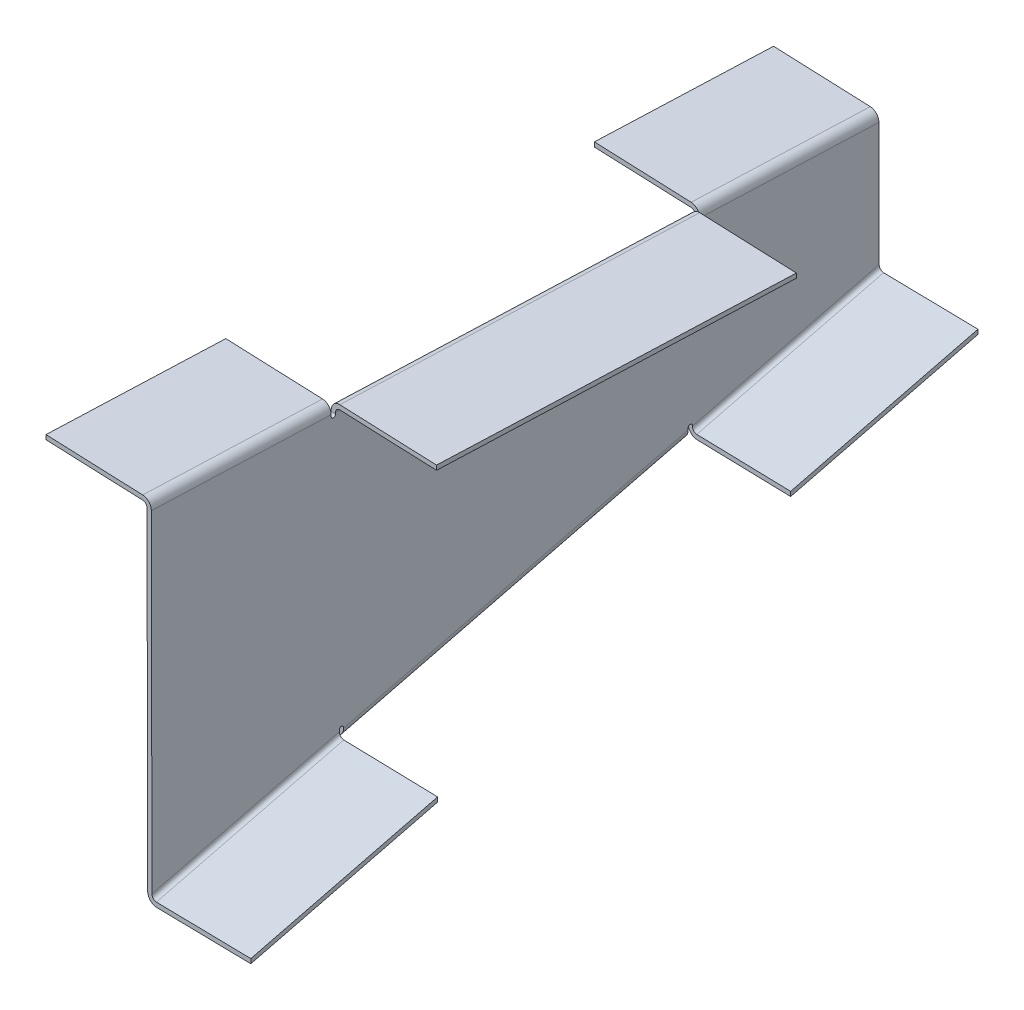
ISO-10303-21;
HEADER;
FILE_DESCRIPTION(('STEP AP214'),'2;1');
FILE_NAME('part.step','',(''),(''),'','','');
FILE_SCHEMA(('AUTOMOTIVE_DESIGN { 1 0 10303 214 1 1 1 1 }'));
ENDSEC;
DATA;
#1=APPLICATION_CONTEXT('core data for automotive mechanical design processes');
#2=APPLICATION_PROTOCOL_DEFINITION('international standard','automotive_design',2000,#1);
#3=PRODUCT_CONTEXT('',#1,'mechanical');
#4=PRODUCT('Part','Part','',(#3));
#5=PRODUCT_RELATED_PRODUCT_CATEGORY('part','',(#4));
#6=PRODUCT_DEFINITION_FORMATION('','',#4);
#7=PRODUCT_DEFINITION_CONTEXT('part definition',#1,'design');
#8=PRODUCT_DEFINITION('design','',#6,#7);
#9=PRODUCT_DEFINITION_SHAPE('','',#8);
#10=(LENGTH_UNIT() NAMED_UNIT(*) SI_UNIT(.MILLI.,.METRE.));
#11=(NAMED_UNIT(*) PLANE_ANGLE_UNIT() SI_UNIT($,.RADIAN.));
#12=(NAMED_UNIT(*) SI_UNIT($,.STERADIAN.) SOLID_ANGLE_UNIT());
#13=UNCERTAINTY_MEASURE_WITH_UNIT(LENGTH_MEASURE(1.E-05),#10,'distance_accuracy_value','');
#14=(GEOMETRIC_REPRESENTATION_CONTEXT(3) GLOBAL_UNCERTAINTY_ASSIGNED_CONTEXT((#13)) GLOBAL_UNIT_ASSIGNED_CONTEXT((#10,
#11,#12)) REPRESENTATION_CONTEXT('',''));
#15=CARTESIAN_POINT('',(0.,0.,0.));
#16=DIRECTION('',(0.,0.,1.));
#17=DIRECTION('',(1.,0.,0.));
#18=AXIS2_PLACEMENT_3D('',#15,#16,#17);
#19=CARTESIAN_POINT('',(0.,-1.62559999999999,0.));
#20=DIRECTION('',(0.,-1.,0.));
#21=DIRECTION('',(0.,0.,-1.));
#22=AXIS2_PLACEMENT_3D('',#19,#20,#21);
#23=PLANE('',#22);
#24=DIRECTION('',(-0.999230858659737,0.,-0.0392134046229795));
#25=VECTOR('',#24,1.);
#26=CARTESIAN_POINT('',(2.48510419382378,-1.62559999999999,-1079.31820027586));
#27=LINE('',#26,#25);
#28=CARTESIAN_POINT('',(2.48510419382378,-1.62559999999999,-1079.31820027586));
#29=VERTEX_POINT('',#28);
#30=CARTESIAN_POINT('',(-33.9548625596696,-1.62559999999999,-1080.7482353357));
#31=VERTEX_POINT('',#30);
#32=EDGE_CURVE('E548',#29,#31,#27,.T.);
#33=ORIENTED_EDGE('',*,*,#32,.T.);
#34=DIRECTION('',(0.0392134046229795,0.,-0.999230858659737));
#35=VECTOR('',#34,1.);
#36=CARTESIAN_POINT('',(-76.2498722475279,-1.62559999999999,-2.99231860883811));
#37=LINE('',#36,#35);
#38=CARTESIAN_POINT('',(-38.8752037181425,-1.62559999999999,-955.368744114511));
#39=VERTEX_POINT('',#38);
#40=EDGE_CURVE('E695',#31,#39,#37,.F.);
#41=ORIENTED_EDGE('',*,*,#40,.T.);
#42=DIRECTION('',(0.999230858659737,0.,0.0392134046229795));
#43=VECTOR('',#42,1.);
#44=CARTESIAN_POINT('',(-40.5059326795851,-1.62559999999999,-955.432739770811));
#45=LINE('',#44,#43);
#46=CARTESIAN_POINT('',(-2.43523696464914,-1.62559999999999,-953.938709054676));
#47=VERTEX_POINT('',#46);
#48=EDGE_CURVE('E489',#39,#47,#45,.T.);
#49=ORIENTED_EDGE('',*,*,#48,.T.);
#50=DIRECTION('',(0.0392134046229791,0.,-0.999230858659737));
#51=VECTOR('',#50,1.);
#52=CARTESIAN_POINT('',(-2.43523696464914,-1.62559999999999,-953.938709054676));
#53=LINE('',#52,#51);
#54=EDGE_CURVE('E545',#47,#29,#53,.T.);
#55=ORIENTED_EDGE('',*,*,#54,.T.);
#56=EDGE_LOOP('',(#33,#41,#49,#55));
#57=FACE_BOUND('',#56,.T.);
#58=ADVANCED_FACE('F76',(#57),#23,.F.);
#59=DIRECTION('',(-0.999230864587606,0.,-0.0392132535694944));
#60=VECTOR('',#59,1.);
#61=CARTESIAN_POINT('',(34.8555989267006,-1.62559999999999,-888.189249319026));
#62=LINE('',#61,#60);
#63=CARTESIAN_POINT('',(-46.2671979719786,-1.62559999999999,-891.372786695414));
#64=VERTEX_POINT('',#63);
#65=CARTESIAN_POINT('',(-82.7199172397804,-1.62559999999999,-892.803316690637));
#66=VERTEX_POINT('',#65);
#67=EDGE_CURVE('E511',#64,#66,#62,.T.);
#68=ORIENTED_EDGE('',*,*,#67,.F.);
#69=DIRECTION('',(0.0392134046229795,0.,-0.999230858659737));
#70=VECTOR('',#69,1.);
#71=CARTESIAN_POINT('',(-43.8080233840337,-1.62559999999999,-954.037152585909));
#72=LINE('',#71,#70);
#73=CARTESIAN_POINT('',(-43.8080233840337,-1.62559999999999,-954.037152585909));
#74=VERTEX_POINT('',#73);
#75=EDGE_CURVE('E364',#64,#74,#72,.T.);
#76=ORIENTED_EDGE('',*,*,#75,.T.);
#77=DIRECTION('',(-0.999230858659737,0.,-0.0392134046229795));
#78=VECTOR('',#77,1.);
#79=CARTESIAN_POINT('',(-42.1900467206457,-1.62559999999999,-953.973657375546));
#80=LINE('',#79,#78);
#81=CARTESIAN_POINT('',(-80.2607424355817,-1.62559999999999,-955.467688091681));
#82=VERTEX_POINT('',#81);
#83=EDGE_CURVE('E490',#74,#82,#80,.T.);
#84=ORIENTED_EDGE('',*,*,#83,.T.);
#85=DIRECTION('',(-0.0392134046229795,0.,0.999230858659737));
#86=VECTOR('',#85,1.);
#87=CARTESIAN_POINT('',(-80.2607424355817,-1.62559999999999,-955.467688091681));
#88=LINE('',#87,#86);
#89=EDGE_CURVE('E486',#82,#66,#88,.T.);
#90=ORIENTED_EDGE('',*,*,#89,.T.);
#91=EDGE_LOOP('',(#68,#76,#84,#90));
#92=FACE_BOUND('',#91,.T.);
#93=ADVANCED_FACE('F871',(#92),#23,.F.);
#94=CARTESIAN_POINT('',(12.0641081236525,-359.190128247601,-106.529065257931));
#95=DIRECTION('',(-0.0321839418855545,0.95822700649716,0.284192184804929));
#96=DIRECTION('',(0.,-0.28433948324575,0.958723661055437));
#97=AXIS2_PLACEMENT_3D('',#94,#95,#96);
#98=PLANE('',#97);
#99=DIRECTION('',(0.9989905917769,0.0219254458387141,0.0392055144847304));
#100=VECTOR('',#99,1.);
#101=CARTESIAN_POINT('',(37.6303477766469,-126.53510316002,-888.089986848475));
#102=LINE('',#101,#100);
#103=CARTESIAN_POINT('',(-41.0896145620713,-128.262817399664,-891.179361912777));
#104=VERTEX_POINT('',#103);
#105=CARTESIAN_POINT('',(-5.52603932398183,-127.48228227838,-889.78366482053));
#106=VERTEX_POINT('',#105);
#107=EDGE_CURVE('E509',#104,#106,#102,.T.);
#108=ORIENTED_EDGE('',*,*,#107,.F.);
#109=DIRECTION('',(-0.0370242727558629,-0.285287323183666,0.95772665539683));
#110=VECTOR('',#109,1.);
#111=CARTESIAN_POINT('',(-71.2789533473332,-360.884149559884,-110.25559727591));
#112=LINE('',#111,#110);
#113=CARTESIAN_POINT('',(-38.5643525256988,-108.804629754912,-956.501664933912));
#114=VERTEX_POINT('',#113);
#115=EDGE_CURVE('E661',#104,#114,#112,.F.);
#116=ORIENTED_EDGE('',*,*,#115,.T.);
#117=DIRECTION('',(0.998795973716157,0.0203014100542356,0.0446593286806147));
#118=VECTOR('',#117,1.);
#119=CARTESIAN_POINT('',(-3.00828195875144,-108.081921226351,-954.911840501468));
#120=LINE('',#119,#118);
#121=CARTESIAN_POINT('',(-3.00828195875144,-108.081921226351,-954.911840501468));
#122=VERTEX_POINT('',#121);
#123=EDGE_CURVE('E505',#114,#122,#120,.T.);
#124=ORIENTED_EDGE('',*,*,#123,.T.);
#125=DIRECTION('',(-0.037024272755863,-0.285287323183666,0.95772665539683));
#126=VECTOR('',#125,1.);
#127=CARTESIAN_POINT('',(-5.53488104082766,-127.550411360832,-889.554951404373));
#128=LINE('',#127,#126);
#129=EDGE_CURVE('E496',#122,#106,#128,.T.);
#130=ORIENTED_EDGE('',*,*,#129,.T.);
#131=EDGE_LOOP('',(#108,#116,#124,#130));
#132=FACE_BOUND('',#131,.T.);
#133=ADVANCED_FACE('F893',(#132),#98,.F.);
#134=DIRECTION('',(0.998795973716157,0.0203014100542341,0.0446593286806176));
#135=VECTOR('',#134,1.);
#136=CARTESIAN_POINT('',(-74.4147952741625,-73.4000397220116,-1079.93730027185));
#137=LINE('',#136,#135);
#138=CARTESIAN_POINT('',(-74.4147952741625,-73.4000397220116,-1079.93730027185));
#139=VERTEX_POINT('',#138);
#140=CARTESIAN_POINT('',(-38.7344327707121,-72.6748048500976,-1078.3419183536));
#141=VERTEX_POINT('',#140);
#142=EDGE_CURVE('E579',#139,#141,#137,.T.);
#143=ORIENTED_EDGE('',*,*,#142,.T.);
#144=DIRECTION('',(-0.0370242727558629,-0.285287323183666,0.95772665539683));
#145=VECTOR('',#144,1.);
#146=CARTESIAN_POINT('',(-43.3800904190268,-108.471517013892,-958.17020854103));
#147=LINE('',#146,#145);
#148=CARTESIAN_POINT('',(-43.3800904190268,-108.471517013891,-958.17020854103));
#149=VERTEX_POINT('',#148);
#150=EDGE_CURVE('E665',#141,#149,#147,.T.);
#151=ORIENTED_EDGE('',*,*,#150,.T.);
#152=DIRECTION('',(-0.998795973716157,-0.0203014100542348,-0.0446593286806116));
#153=VECTOR('',#152,1.);
#154=CARTESIAN_POINT('',(-41.8182963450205,-108.439772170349,-958.100375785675));
#155=LINE('',#154,#153);
#156=CARTESIAN_POINT('',(-79.0604529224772,-109.196751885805,-959.765590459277));
#157=VERTEX_POINT('',#156);
#158=EDGE_CURVE('E499',#149,#157,#155,.T.);
#159=ORIENTED_EDGE('',*,*,#158,.T.);
#160=DIRECTION('',(0.037024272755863,0.285287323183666,-0.95772665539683));
#161=VECTOR('',#160,1.);
#162=CARTESIAN_POINT('',(-79.0604529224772,-109.196751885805,-959.765590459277));
#163=LINE('',#162,#161);
#164=EDGE_CURVE('E576',#157,#139,#163,.T.);
#165=ORIENTED_EDGE('',*,*,#164,.T.);
#166=EDGE_LOOP('',(#143,#151,#159,#165));
#167=FACE_BOUND('',#166,.T.);
#168=ADVANCED_FACE('F802',(#167),#98,.F.);
#169=CARTESIAN_POINT('',(44.8048040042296,0.0880050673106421,-1141.71457268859));
#170=DIRECTION('',(0.0392132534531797,7.70222097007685E-05,-0.999230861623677));
#171=DIRECTION('',(-0.999230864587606,0.,-0.0392132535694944));
#172=AXIS2_PLACEMENT_3D('',#169,#170,#171);
#173=PLANE('',#172);
#174=DIRECTION('',(0.999230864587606,0.,0.0392132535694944));
#175=VECTOR('',#174,1.);
#176=CARTESIAN_POINT('',(44.8048091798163,-1.62559999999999,-1141.71470457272));
#177=LINE('',#176,#175);
#178=CARTESIAN_POINT('',(-72.7706686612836,-1.62559999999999,-1146.32877044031));
#179=VERTEX_POINT('',#178);
#180=CARTESIAN_POINT('',(-36.3179493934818,-1.62559999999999,-1144.89824044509));
#181=VERTEX_POINT('',#180);
#182=EDGE_CURVE('E613',#179,#181,#177,.T.);
#183=ORIENTED_EDGE('',*,*,#182,.T.);
#184=CARTESIAN_POINT('',(-36.3179395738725,-4.87679999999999,-1144.89849066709));
#185=DIRECTION('',(0.0392132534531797,7.70222097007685E-05,-0.999230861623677));
#186=DIRECTION('',(-0.00196418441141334,0.999998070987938,0.));
#187=AXIS2_PLACEMENT_3D('',#184,#185,#186);
#188=ELLIPSE('',#187,3.25120000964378,3.2512);
#189=CARTESIAN_POINT('',(-33.0692464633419,-4.87041895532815,-1144.77100029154));
#190=VERTEX_POINT('',#189);
#191=EDGE_CURVE('E702',#181,#190,#188,.T.);
#192=ORIENTED_EDGE('',*,*,#191,.T.);
#193=DIRECTION('',(-0.00196418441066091,0.99999807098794,0.));
#194=VECTOR('',#193,1.);
#195=CARTESIAN_POINT('',(-33.0786852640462,-0.0649727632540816,-1144.77100029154));
#196=LINE('',#195,#194);
#197=CARTESIAN_POINT('',(-32.9817322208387,-49.4253361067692,-1144.77100029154));
#198=VERTEX_POINT('',#197);
#199=EDGE_CURVE('E542',#198,#190,#196,.T.);
#200=ORIENTED_EDGE('',*,*,#199,.F.);
#201=CARTESIAN_POINT('',(-31.3573856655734,-49.4221455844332,-1144.70725510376));
#202=DIRECTION('',(0.0392132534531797,7.70222097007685E-05,-0.999230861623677));
#203=DIRECTION('',(-0.00196418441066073,0.99999807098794,0.));
#204=AXIS2_PLACEMENT_3D('',#201,#202,#203);
#205=ELLIPSE('',#204,1.69604727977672,1.6256);
#206=CARTESIAN_POINT('',(-31.3229741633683,-51.1178180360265,-1144.70603538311));
#207=VERTEX_POINT('',#206);
#208=EDGE_CURVE('E646',#198,#207,#205,.F.);
#209=ORIENTED_EDGE('',*,*,#208,.T.);
#210=DIRECTION('',(-0.9989905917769,-0.0219254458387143,-0.0392055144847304));
#211=VECTOR('',#210,1.);
#212=CARTESIAN_POINT('',(45.9223536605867,-49.4224684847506,-1141.67453254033));
#213=LINE('',#212,#211);
#214=CARTESIAN_POINT('',(4.27168061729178,-50.3366007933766,-1143.30911857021));
#215=VERTEX_POINT('',#214);
#216=EDGE_CURVE('E598',#215,#207,#213,.T.);
#217=ORIENTED_EDGE('',*,*,#216,.F.);
#218=DIRECTION('',(-0.00196418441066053,0.99999807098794,0.));
#219=VECTOR('',#218,1.);
#220=CARTESIAN_POINT('',(4.30988616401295,-69.7876629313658,-1143.30911857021));
#221=LINE('',#220,#219);
#222=CARTESIAN_POINT('',(4.27487359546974,-51.9621976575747,-1143.30911857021));
#223=VERTEX_POINT('',#222);
#224=EDGE_CURVE('E604',#223,#215,#221,.T.);
#225=ORIENTED_EDGE('',*,*,#224,.F.);
#226=DIRECTION('',(-0.9989905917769,-0.0219254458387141,-0.0392055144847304));
#227=VECTOR('',#226,1.);
#228=CARTESIAN_POINT('',(45.9255466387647,-51.0480653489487,-1141.67453254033));
#229=LINE('',#228,#227);
#230=CARTESIAN_POINT('',(-31.2887016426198,-52.7427327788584,-1144.70481566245));
#231=VERTEX_POINT('',#230);
#232=EDGE_CURVE('E439',#223,#231,#229,.T.);
#233=ORIENTED_EDGE('',*,*,#232,.T.);
#234=CARTESIAN_POINT('',(-31.3575246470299,-49.3513878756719,-1144.70725510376));
#235=DIRECTION('',(0.0392132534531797,7.70222097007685E-05,-0.999230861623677));
#236=DIRECTION('',(0.00196418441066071,-0.99999807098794,0.));
#237=AXIS2_PLACEMENT_3D('',#234,#235,#236);
#238=ELLIPSE('',#237,3.39209455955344,3.2512);
#239=CARTESIAN_POINT('',(-34.6062177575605,-49.3577689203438,-1144.83474547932));
#240=VERTEX_POINT('',#239);
#241=EDGE_CURVE('E678',#231,#240,#238,.T.);
#242=ORIENTED_EDGE('',*,*,#241,.T.);
#243=DIRECTION('',(-0.00196418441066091,0.99999807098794,0.));
#244=VECTOR('',#243,1.);
#245=CARTESIAN_POINT('',(-34.7030318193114,-0.0681632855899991,-1144.83474547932));
#246=LINE('',#245,#244);
#247=CARTESIAN_POINT('',(-34.6935930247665,-4.87360634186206,-1144.83474547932));
#248=VERTEX_POINT('',#247);
#249=EDGE_CURVE('E610',#240,#248,#246,.T.);
#250=ORIENTED_EDGE('',*,*,#249,.T.);
#251=CARTESIAN_POINT('',(-36.3179395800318,-4.87679686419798,-1144.89849066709));
#252=DIRECTION('',(0.0392132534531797,7.70222097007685E-05,-0.999230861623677));
#253=DIRECTION('',(0.00196418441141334,-0.999998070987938,0.));
#254=AXIS2_PLACEMENT_3D('',#251,#252,#253);
#255=ELLIPSE('',#254,1.62560000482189,1.6256);
#256=CARTESIAN_POINT('',(-36.3179444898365,-3.25119686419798,-1144.89836555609));
#257=VERTEX_POINT('',#256);
#258=EDGE_CURVE('E724',#248,#257,#255,.F.);
#259=ORIENTED_EDGE('',*,*,#258,.T.);
#260=DIRECTION('',(0.999230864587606,0.,0.0392132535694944));
#261=VECTOR('',#260,1.);
#262=CARTESIAN_POINT('',(44.8080021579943,-3.25119686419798,-1141.71470457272));
#263=LINE('',#262,#261);
#264=CARTESIAN_POINT('',(-72.7674756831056,-3.25119686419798,-1146.32877044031));
#265=VERTEX_POINT('',#264);
#266=EDGE_CURVE('E601',#265,#257,#263,.T.);
#267=ORIENTED_EDGE('',*,*,#266,.F.);
#268=DIRECTION('',(0.00196418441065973,-0.99999807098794,0.));
#269=VECTOR('',#268,1.);
#270=CARTESIAN_POINT('',(-72.7674756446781,-3.25121642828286,-1146.32877044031));
#271=LINE('',#270,#269);
#272=EDGE_CURVE('E607',#179,#265,#271,.T.);
#273=ORIENTED_EDGE('',*,*,#272,.F.);
#274=EDGE_LOOP('',(#183,#192,#200,#209,#217,#225,#233,#242,#250,#259,#267,#273));
#275=FACE_BOUND('',#274,.T.);
#276=ADVANCED_FACE('F478',(#275),#173,.T.);
#277=CARTESIAN_POINT('',(0.00319297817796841,-3.25119686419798,0.));
#278=DIRECTION('',(0.,-1.,0.));
#279=DIRECTION('',(0.,0.,-1.));
#280=AXIS2_PLACEMENT_3D('',#277,#278,#279);
#281=PLANE('',#280);
#282=ORIENTED_EDGE('',*,*,#266,.T.);
#283=DIRECTION('',(0.0392134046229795,0.,-0.999230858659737));
#284=VECTOR('',#283,1.);
#285=CARTESIAN_POINT('',(-81.1229257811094,-3.25119686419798,-3.18368002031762));
#286=LINE('',#285,#284);
#287=CARTESIAN_POINT('',(-38.7681548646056,-3.25119686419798,-1082.46242457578));
#288=VERTEX_POINT('',#287);
#289=EDGE_CURVE('E717',#257,#288,#286,.F.);
#290=ORIENTED_EDGE('',*,*,#289,.T.);
#291=DIRECTION('',(0.999230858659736,0.,0.0392134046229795));
#292=VECTOR('',#291,1.);
#293=CARTESIAN_POINT('',(-75.2176858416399,-3.25119686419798,-1083.89283497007));
#294=LINE('',#293,#292);
#295=CARTESIAN_POINT('',(-75.2176858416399,-3.25119686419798,-1083.89283497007));
#296=VERTEX_POINT('',#295);
#297=EDGE_CURVE('E526',#296,#288,#294,.T.);
#298=ORIENTED_EDGE('',*,*,#297,.F.);
#299=DIRECTION('',(-0.0392134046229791,0.,0.999230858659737));
#300=VECTOR('',#299,1.);
#301=CARTESIAN_POINT('',(-72.7575152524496,-3.25119686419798,-1146.5825808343));
#302=LINE('',#301,#300);
#303=EDGE_CURVE('E538',#265,#296,#302,.T.);
#304=ORIENTED_EDGE('',*,*,#303,.F.);
#305=EDGE_LOOP('',(#282,#290,#298,#304));
#306=FACE_BOUND('',#305,.T.);
#307=ADVANCED_FACE('F747',(#306),#281,.T.);
#308=DIRECTION('',(-0.999230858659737,0.,-0.0392134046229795));
#309=VECTOR('',#308,1.);
#310=CARTESIAN_POINT('',(-42.1868537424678,-3.25119686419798,-953.973657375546));
#311=LINE('',#310,#309);
#312=CARTESIAN_POINT('',(-43.8080184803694,-3.25119686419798,-954.037277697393));
#313=VERTEX_POINT('',#312);
#314=CARTESIAN_POINT('',(-80.2575494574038,-3.25119686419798,-955.467688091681));
#315=VERTEX_POINT('',#314);
#316=EDGE_CURVE('E495',#313,#315,#311,.T.);
#317=ORIENTED_EDGE('',*,*,#316,.F.);
#318=DIRECTION('',(0.0392134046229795,0.,-0.999230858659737));
#319=VECTOR('',#318,1.);
#320=CARTESIAN_POINT('',(-81.1229257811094,-3.25119686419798,-3.18368002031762));
#321=LINE('',#320,#319);
#322=CARTESIAN_POINT('',(-46.2671930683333,-3.25119686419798,-891.372911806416));
#323=VERTEX_POINT('',#322);
#324=EDGE_CURVE('E97',#313,#323,#321,.F.);
#325=ORIENTED_EDGE('',*,*,#324,.T.);
#326=DIRECTION('',(-0.999230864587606,0.,-0.0392132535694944));
#327=VECTOR('',#326,1.);
#328=CARTESIAN_POINT('',(34.8587919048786,-3.25119686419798,-888.189249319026));
#329=LINE('',#328,#327);
#330=CARTESIAN_POINT('',(-82.7167242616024,-3.25119686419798,-892.803316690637));
#331=VERTEX_POINT('',#330);
#332=EDGE_CURVE('E520',#323,#331,#329,.T.);
#333=ORIENTED_EDGE('',*,*,#332,.T.);
#334=DIRECTION('',(-0.0392134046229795,0.,0.999230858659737));
#335=VECTOR('',#334,1.);
#336=CARTESIAN_POINT('',(-80.2575494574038,-3.25119686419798,-955.467688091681));
#337=LINE('',#336,#335);
#338=EDGE_CURVE('E491',#315,#331,#337,.T.);
#339=ORIENTED_EDGE('',*,*,#338,.F.);
#340=EDGE_LOOP('',(#317,#325,#333,#339));
#341=FACE_BOUND('',#340,.T.);
#342=ADVANCED_FACE('F864',(#341),#281,.T.);
#343=CARTESIAN_POINT('',(12.0609151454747,-357.564531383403,-106.529065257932));
#344=DIRECTION('',(-0.0321839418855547,0.95822700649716,0.284192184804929));
#345=DIRECTION('',(0.,-0.284339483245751,0.958723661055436));
#346=AXIS2_PLACEMENT_3D('',#343,#344,#345);
#347=PLANE('',#346);
#348=DIRECTION('',(-0.998795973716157,-0.0203014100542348,-0.0446593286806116));
#349=VECTOR('',#348,1.);
#350=CARTESIAN_POINT('',(-41.8214893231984,-106.814175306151,-958.100375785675));
#351=LINE('',#350,#349);
#352=CARTESIAN_POINT('',(-43.4143563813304,-106.846551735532,-958.171597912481));
#353=VERTEX_POINT('',#352);
#354=CARTESIAN_POINT('',(-79.0636459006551,-107.571155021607,-959.765590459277));
#355=VERTEX_POINT('',#354);
#356=EDGE_CURVE('E504',#353,#355,#351,.T.);
#357=ORIENTED_EDGE('',*,*,#356,.F.);
#358=DIRECTION('',(-0.0370242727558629,-0.285287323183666,0.95772665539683));
#359=VECTOR('',#358,1.);
#360=CARTESIAN_POINT('',(-76.1850394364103,-359.358208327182,-110.474821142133));
#361=LINE('',#360,#359);
#362=CARTESIAN_POINT('',(-38.7686987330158,-71.0498395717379,-1078.34330772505));
#363=VERTEX_POINT('',#362);
#364=EDGE_CURVE('E628',#353,#363,#361,.F.);
#365=ORIENTED_EDGE('',*,*,#364,.T.);
#366=DIRECTION('',(0.998795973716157,0.0203014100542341,0.0446593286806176));
#367=VECTOR('',#366,1.);
#368=CARTESIAN_POINT('',(-74.4179882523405,-71.7744428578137,-1079.93730027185));
#369=LINE('',#368,#367);
#370=CARTESIAN_POINT('',(-74.4179882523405,-71.7744428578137,-1079.93730027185));
#371=VERTEX_POINT('',#370);
#372=EDGE_CURVE('E565',#371,#363,#369,.T.);
#373=ORIENTED_EDGE('',*,*,#372,.F.);
#374=DIRECTION('',(0.037024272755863,0.285287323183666,-0.95772665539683));
#375=VECTOR('',#374,1.);
#376=CARTESIAN_POINT('',(-79.0636459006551,-107.571155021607,-959.765590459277));
#377=LINE('',#376,#375);
#378=EDGE_CURVE('E562',#355,#371,#377,.T.);
#379=ORIENTED_EDGE('',*,*,#378,.F.);
#380=EDGE_LOOP('',(#357,#365,#373,#379));
#381=FACE_BOUND('',#380,.T.);
#382=ADVANCED_FACE('F814',(#381),#347,.T.);
#383=CARTESIAN_POINT('',(-2.43204398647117,-3.25119686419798,-953.938709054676));
#384=DIRECTION('',(0.999228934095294,0.00196267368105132,0.0392133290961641));
#385=DIRECTION('',(0.0392134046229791,0.,-0.999230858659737));
#386=AXIS2_PLACEMENT_3D('',#383,#384,#385);
#387=PLANE('',#386);
#388=ORIENTED_EDGE('',*,*,#54,.F.);
#389=DIRECTION('',(-0.0019641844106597,0.99999807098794,0.));
#390=VECTOR('',#389,1.);
#391=CARTESIAN_POINT('',(-2.43204398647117,-3.25119686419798,-953.938709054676));
#392=LINE('',#391,#390);
#393=CARTESIAN_POINT('',(-2.43204398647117,-3.25119686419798,-953.938709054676));
#394=VERTEX_POINT('',#393);
#395=EDGE_CURVE('E555',#394,#47,#392,.T.);
#396=ORIENTED_EDGE('',*,*,#395,.F.);
#397=DIRECTION('',(0.0392134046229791,0.,-0.999230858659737));
#398=VECTOR('',#397,1.);
#399=CARTESIAN_POINT('',(-2.43204398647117,-3.25119686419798,-953.938709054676));
#400=LINE('',#399,#398);
#401=CARTESIAN_POINT('',(2.48829717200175,-3.25119686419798,-1079.31820027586));
#402=VERTEX_POINT('',#401);
#403=EDGE_CURVE('E532',#394,#402,#400,.T.);
#404=ORIENTED_EDGE('',*,*,#403,.T.);
#405=DIRECTION('',(-0.0019641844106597,0.99999807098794,0.));
#406=VECTOR('',#405,1.);
#407=CARTESIAN_POINT('',(2.48829717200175,-3.25119686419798,-1079.31820027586));
#408=LINE('',#407,#406);
#409=EDGE_CURVE('E553',#402,#29,#408,.T.);
#410=ORIENTED_EDGE('',*,*,#409,.T.);
#411=EDGE_LOOP('',(#388,#396,#404,#410));
#412=FACE_BOUND('',#411,.T.);
#413=ADVANCED_FACE('F916',(#412),#387,.T.);
#414=CARTESIAN_POINT('',(-80.2575494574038,-3.25119686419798,-955.467688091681));
#415=DIRECTION('',(-0.999228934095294,-0.00196267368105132,-0.0392133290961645));
#416=DIRECTION('',(-0.0392134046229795,0.,0.999230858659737));
#417=AXIS2_PLACEMENT_3D('',#414,#415,#416);
#418=PLANE('',#417);
#419=ORIENTED_EDGE('',*,*,#338,.T.);
#420=DIRECTION('',(-0.00196418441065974,0.99999807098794,0.));
#421=VECTOR('',#420,1.);
#422=CARTESIAN_POINT('',(-82.7167147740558,-3.25602712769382,-892.803316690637));
#423=LINE('',#422,#421);
#424=EDGE_CURVE('E522',#331,#66,#423,.T.);
#425=ORIENTED_EDGE('',*,*,#424,.T.);
#426=ORIENTED_EDGE('',*,*,#89,.F.);
#427=DIRECTION('',(-0.0019641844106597,0.99999807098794,0.));
#428=VECTOR('',#427,1.);
#429=CARTESIAN_POINT('',(-80.2575494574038,-3.25119686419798,-955.467688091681));
#430=LINE('',#429,#428);
#431=EDGE_CURVE('E558',#315,#82,#430,.T.);
#432=ORIENTED_EDGE('',*,*,#431,.F.);
#433=EDGE_LOOP('',(#419,#425,#426,#432));
#434=FACE_BOUND('',#433,.T.);
#435=ADVANCED_FACE('F867',(#434),#418,.T.);
#436=CARTESIAN_POINT('',(-42.1868537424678,-3.25119686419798,-953.973657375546));
#437=DIRECTION('',(0.0392134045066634,7.70225063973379E-05,-0.999230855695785));
#438=DIRECTION('',(-0.999230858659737,0.,-0.0392134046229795));
#439=AXIS2_PLACEMENT_3D('',#436,#437,#438);
#440=PLANE('',#439);
#441=ORIENTED_EDGE('',*,*,#83,.F.);
#442=CARTESIAN_POINT('',(-43.8080135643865,-4.87679999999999,-954.037402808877));
#443=DIRECTION('',(0.0392134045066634,7.70225063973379E-05,-0.999230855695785));
#444=DIRECTION('',(-3.02031452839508E-06,0.999999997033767,7.69632652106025E-05));
#445=AXIS2_PLACEMENT_3D('',#442,#443,#444);
#446=ELLIPSE('',#445,3.25120000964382,3.2512);
#447=CARTESIAN_POINT('',(-40.5593204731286,-4.87041895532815,-953.909911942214));
#448=VERTEX_POINT('',#447);
#449=EDGE_CURVE('E360',#74,#448,#446,.T.);
#450=ORIENTED_EDGE('',*,*,#449,.T.);
#451=DIRECTION('',(0.00196418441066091,-0.99999807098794,0.));
#452=VECTOR('',#451,1.);
#453=CARTESIAN_POINT('',(-40.5687303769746,-0.0796846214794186,-953.909911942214));
#454=LINE('',#453,#452);
#455=CARTESIAN_POINT('',(-40.5582102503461,-5.43565134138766,-953.909911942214));
#456=VERTEX_POINT('',#455);
#457=EDGE_CURVE('E354',#448,#456,#454,.T.);
#458=ORIENTED_EDGE('',*,*,#457,.T.);
#459=DIRECTION('',(0.999230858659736,0.,0.0392134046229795));
#460=VECTOR('',#459,1.);
#461=CARTESIAN_POINT('',(-47.2389530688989,-5.43565134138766,-954.172088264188));
#462=LINE('',#461,#460);
#463=CARTESIAN_POINT('',(-42.1825630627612,-5.43565134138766,-953.973657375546));
#464=VERTEX_POINT('',#463);
#465=EDGE_CURVE('E358',#464,#456,#462,.T.);
#466=ORIENTED_EDGE('',*,*,#465,.F.);
#467=DIRECTION('',(-0.00196418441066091,0.99999807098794,0.));
#468=VECTOR('',#467,1.);
#469=CARTESIAN_POINT('',(-42.1900662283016,-1.61566833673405,-953.973657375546));
#470=LINE('',#469,#468);
#471=CARTESIAN_POINT('',(-42.1836670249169,-4.87360634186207,-953.973657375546));
#472=VERTEX_POINT('',#471);
#473=EDGE_CURVE('E390',#464,#472,#470,.T.);
#474=ORIENTED_EDGE('',*,*,#473,.T.);
#475=CARTESIAN_POINT('',(-43.8080135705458,-4.87679686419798,-954.037402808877));
#476=DIRECTION('',(0.0392134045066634,7.70225063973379E-05,-0.999230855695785));
#477=DIRECTION('',(3.02031452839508E-06,-0.999999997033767,-7.69632652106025E-05));
#478=AXIS2_PLACEMENT_3D('',#475,#476,#477);
#479=ELLIPSE('',#478,1.62560000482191,1.6256);
#480=EDGE_CURVE('E84',#472,#313,#479,.F.);
#481=ORIENTED_EDGE('',*,*,#480,.T.);
#482=ORIENTED_EDGE('',*,*,#316,.T.);
#483=ORIENTED_EDGE('',*,*,#431,.T.);
#484=EDGE_LOOP('',(#441,#450,#458,#466,#474,#481,#482,#483));
#485=FACE_BOUND('',#484,.T.);
#486=ADVANCED_FACE('F357',(#485),#440,.T.);
#487=CARTESIAN_POINT('',(-75.2176858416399,-3.25119686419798,-1083.89283497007));
#488=DIRECTION('',(-0.0392134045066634,-7.7022506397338E-05,0.999230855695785));
#489=DIRECTION('',(0.999230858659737,0.,0.0392134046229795));
#490=AXIS2_PLACEMENT_3D('',#487,#488,#489);
#491=PLANE('',#490);
#492=DIRECTION('',(-0.0019641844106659,0.99999807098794,0.));
#493=VECTOR('',#492,1.);
#494=CARTESIAN_POINT('',(-35.5258302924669,-1.62559999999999,-1082.3350588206));
#495=LINE('',#494,#493);
#496=CARTESIAN_POINT('',(-35.5183468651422,-5.43553395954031,-1082.3350588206));
#497=VERTEX_POINT('',#496);
#498=CARTESIAN_POINT('',(-35.519456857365,-4.87041895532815,-1082.3350588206));
#499=VERTEX_POINT('',#498);
#500=EDGE_CURVE('E384',#497,#499,#495,.T.);
#501=ORIENTED_EDGE('',*,*,#500,.T.);
#502=CARTESIAN_POINT('',(-38.7681499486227,-4.87679999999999,-1082.46254968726));
#503=DIRECTION('',(-0.0392134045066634,-7.7022506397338E-05,0.999230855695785));
#504=DIRECTION('',(-3.02031416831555E-06,0.999999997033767,7.69632652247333E-05));
#505=AXIS2_PLACEMENT_3D('',#502,#503,#504);
#506=ELLIPSE('',#505,3.25120000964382,3.2512);
#507=CARTESIAN_POINT('',(-38.7681597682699,-1.62559999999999,-1082.46229946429));
#508=VERTEX_POINT('',#507);
#509=EDGE_CURVE('E704',#499,#508,#506,.T.);
#510=ORIENTED_EDGE('',*,*,#509,.T.);
#511=DIRECTION('',(0.999230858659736,0.,0.0392134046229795));
#512=VECTOR('',#511,1.);
#513=CARTESIAN_POINT('',(-75.2208788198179,-1.62559999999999,-1083.89283497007));
#514=LINE('',#513,#512);
#515=CARTESIAN_POINT('',(-75.2208788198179,-1.62559999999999,-1083.89283497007));
#516=VERTEX_POINT('',#515);
#517=EDGE_CURVE('E539',#516,#508,#514,.T.);
#518=ORIENTED_EDGE('',*,*,#517,.F.);
#519=DIRECTION('',(-0.0019641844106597,0.99999807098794,0.));
#520=VECTOR('',#519,1.);
#521=CARTESIAN_POINT('',(-75.2176858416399,-3.25119686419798,-1083.89283497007));
#522=LINE('',#521,#520);
#523=EDGE_CURVE('E500',#296,#516,#522,.T.);
#524=ORIENTED_EDGE('',*,*,#523,.F.);
#525=ORIENTED_EDGE('',*,*,#297,.T.);
#526=CARTESIAN_POINT('',(-38.768149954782,-4.87679686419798,-1082.46254968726));
#527=DIRECTION('',(-0.0392134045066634,-7.7022506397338E-05,0.999230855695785));
#528=DIRECTION('',(3.02031416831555E-06,-0.999999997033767,-7.69632652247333E-05));
#529=AXIS2_PLACEMENT_3D('',#526,#527,#528);
#530=ELLIPSE('',#529,1.62560000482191,1.6256);
#531=CARTESIAN_POINT('',(-37.1438034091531,-4.87360634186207,-1082.39880425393));
#532=VERTEX_POINT('',#531);
#533=EDGE_CURVE('E726',#288,#532,#530,.F.);
#534=ORIENTED_EDGE('',*,*,#533,.T.);
#535=DIRECTION('',(0.00196418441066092,-0.99999807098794,0.));
#536=VECTOR('',#535,1.);
#537=CARTESIAN_POINT('',(-37.1502026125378,-1.61566833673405,-1082.39880425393));
#538=LINE('',#537,#536);
#539=CARTESIAN_POINT('',(-37.1426996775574,-5.43553395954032,-1082.39880425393));
#540=VERTEX_POINT('',#539);
#541=EDGE_CURVE('E392',#532,#540,#538,.T.);
#542=ORIENTED_EDGE('',*,*,#541,.T.);
#543=DIRECTION('',(0.999230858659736,0.,0.0392134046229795));
#544=VECTOR('',#543,1.);
#545=CARTESIAN_POINT('',(-42.1990896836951,-5.43553395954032,-1082.59723514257));
#546=LINE('',#545,#544);
#547=EDGE_CURVE('E395',#540,#497,#546,.T.);
#548=ORIENTED_EDGE('',*,*,#547,.T.);
#549=EDGE_LOOP('',(#501,#510,#518,#524,#525,#534,#542,#548));
#550=FACE_BOUND('',#549,.T.);
#551=ADVANCED_FACE('F730',(#550),#491,.T.);
#552=CARTESIAN_POINT('',(-72.7575152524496,-3.25119686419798,-1146.5825808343));
#553=DIRECTION('',(-0.999228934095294,-0.00196267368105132,-0.0392133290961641));
#554=DIRECTION('',(-0.0392134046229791,0.,0.999230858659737));
#555=AXIS2_PLACEMENT_3D('',#552,#553,#554);
#556=PLANE('',#555);
#557=DIRECTION('',(-0.0392134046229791,0.,0.999230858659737));
#558=VECTOR('',#557,1.);
#559=CARTESIAN_POINT('',(-72.7607082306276,-1.62559999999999,-1146.5825808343));
#560=LINE('',#559,#558);
#561=EDGE_CURVE('E529',#179,#516,#560,.T.);
#562=ORIENTED_EDGE('',*,*,#561,.F.);
#563=ORIENTED_EDGE('',*,*,#272,.T.);
#564=ORIENTED_EDGE('',*,*,#303,.T.);
#565=ORIENTED_EDGE('',*,*,#523,.T.);
#566=EDGE_LOOP('',(#562,#563,#564,#565));
#567=FACE_BOUND('',#566,.T.);
#568=ADVANCED_FACE('F749',(#567),#556,.T.);
#569=CARTESIAN_POINT('',(-74.4179882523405,-71.7744428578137,-1079.93730027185));
#570=DIRECTION('',(0.0446667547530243,8.77339125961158E-05,-0.999001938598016));
#571=DIRECTION('',(-0.999001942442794,0.,-0.0446667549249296));
#572=AXIS2_PLACEMENT_3D('',#569,#570,#571);
#573=PLANE('',#572);
#574=DIRECTION('',(0.00196418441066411,-0.99999807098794,0.));
#575=VECTOR('',#574,1.);
#576=CARTESIAN_POINT('',(-35.5486986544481,-72.6100519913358,-1078.19947409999));
#577=LINE('',#576,#575);
#578=CARTESIAN_POINT('',(-35.5566090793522,-68.5827266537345,-1078.19947409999));
#579=VERTEX_POINT('',#578);
#580=CARTESIAN_POINT('',(-35.5552350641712,-69.2822600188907,-1078.19947409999));
#581=VERTEX_POINT('',#580);
#582=EDGE_CURVE('E462',#579,#581,#577,.T.);
#583=ORIENTED_EDGE('',*,*,#582,.T.);
#584=CARTESIAN_POINT('',(-38.8032426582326,-69.2833588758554,-1078.3446970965));
#585=DIRECTION('',(0.0446667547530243,8.77339125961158E-05,-0.999001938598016));
#586=DIRECTION('',(-0.020285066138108,0.999793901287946,-0.000819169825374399));
#587=AXIS2_PLACEMENT_3D('',#584,#585,#586);
#588=ELLIPSE('',#587,3.39214509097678,3.2512);
#589=EDGE_CURVE('E672',#581,#141,#588,.T.);
#590=ORIENTED_EDGE('',*,*,#589,.T.);
#591=ORIENTED_EDGE('',*,*,#142,.F.);
#592=DIRECTION('',(0.00196418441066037,-0.99999807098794,0.));
#593=VECTOR('',#592,1.);
#594=CARTESIAN_POINT('',(-74.4179882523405,-71.7744428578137,-1079.93730027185));
#595=LINE('',#594,#593);
#596=EDGE_CURVE('E592',#371,#139,#595,.T.);
#597=ORIENTED_EDGE('',*,*,#596,.F.);
#598=ORIENTED_EDGE('',*,*,#372,.T.);
#599=CARTESIAN_POINT('',(-38.803103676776,-69.3541165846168,-1078.3446970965));
#600=DIRECTION('',(0.0446667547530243,8.77339125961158E-05,-0.999001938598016));
#601=DIRECTION('',(0.020285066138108,-0.999793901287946,0.000819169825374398));
#602=AXIS2_PLACEMENT_3D('',#599,#600,#601);
#603=ELLIPSE('',#602,1.69607254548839,1.6256);
#604=CARTESIAN_POINT('',(-37.1790998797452,-69.3535671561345,-1078.27208559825));
#605=VERTEX_POINT('',#604);
#606=EDGE_CURVE('E642',#363,#605,#603,.F.);
#607=ORIENTED_EDGE('',*,*,#606,.T.);
#608=DIRECTION('',(-0.00196418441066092,0.99999807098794,0.));
#609=VECTOR('',#608,1.);
#610=CARTESIAN_POINT('',(-37.1724502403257,-72.7390061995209,-1078.27208559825));
#611=LINE('',#610,#609);
#612=CARTESIAN_POINT('',(-37.1805491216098,-68.6157346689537,-1078.27208559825));
#613=VERTEX_POINT('',#612);
#614=EDGE_CURVE('E457',#605,#613,#611,.T.);
#615=ORIENTED_EDGE('',*,*,#614,.T.);
#616=DIRECTION('',(0.998795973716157,0.0203014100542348,0.0446593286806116));
#617=VECTOR('',#616,1.);
#618=CARTESIAN_POINT('',(-42.4059144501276,-68.7219448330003,-1078.50572821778));
#619=LINE('',#618,#617);
#620=EDGE_CURVE('E463',#613,#579,#619,.T.);
#621=ORIENTED_EDGE('',*,*,#620,.T.);
#622=EDGE_LOOP('',(#583,#590,#591,#597,#598,#607,#615,#621));
#623=FACE_BOUND('',#622,.T.);
#624=ADVANCED_FACE('F795',(#623),#573,.T.);
#625=CARTESIAN_POINT('',(-79.0636459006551,-107.571155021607,-959.765590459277));
#626=DIRECTION('',(-0.999228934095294,-0.00196267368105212,-0.0392133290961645));
#627=DIRECTION('',(-0.0392134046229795,0.,0.999230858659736));
#628=AXIS2_PLACEMENT_3D('',#625,#626,#627);
#629=PLANE('',#628);
#630=ORIENTED_EDGE('',*,*,#164,.F.);
#631=DIRECTION('',(0.00196418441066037,-0.99999807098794,0.));
#632=VECTOR('',#631,1.);
#633=CARTESIAN_POINT('',(-79.0636459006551,-107.571155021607,-959.765590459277));
#634=LINE('',#633,#632);
#635=EDGE_CURVE('E574',#355,#157,#634,.T.);
#636=ORIENTED_EDGE('',*,*,#635,.F.);
#637=ORIENTED_EDGE('',*,*,#378,.T.);
#638=ORIENTED_EDGE('',*,*,#596,.T.);
#639=EDGE_LOOP('',(#630,#636,#637,#638));
#640=FACE_BOUND('',#639,.T.);
#641=ADVANCED_FACE('F810',(#640),#629,.T.);
#642=CARTESIAN_POINT('',(-41.8214893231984,-106.814175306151,-958.100375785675));
#643=DIRECTION('',(-0.0446667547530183,-8.77339125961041E-05,0.999001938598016));
#644=DIRECTION('',(0.999001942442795,0.,0.0446667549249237));
#645=AXIS2_PLACEMENT_3D('',#642,#643,#644);
#646=PLANE('',#645);
#647=ORIENTED_EDGE('',*,*,#158,.F.);
#648=CARTESIAN_POINT('',(-43.4489003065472,-105.080071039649,-958.172987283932));
#649=DIRECTION('',(-0.0446667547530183,-8.77339125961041E-05,0.999001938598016));
#650=DIRECTION('',(-0.0202850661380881,0.999793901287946,-0.000819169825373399));
#651=AXIS2_PLACEMENT_3D('',#648,#649,#650);
#652=ELLIPSE('',#651,3.39214509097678,3.2512);
#653=CARTESIAN_POINT('',(-40.2008927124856,-105.078972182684,-958.027764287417));
#654=VERTEX_POINT('',#653);
#655=EDGE_CURVE('E668',#149,#654,#652,.T.);
#656=ORIENTED_EDGE('',*,*,#655,.T.);
#657=DIRECTION('',(-0.00196418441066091,0.99999807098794,0.));
#658=VECTOR('',#657,1.);
#659=CARTESIAN_POINT('',(-40.4071316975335,-0.0793672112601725,-958.027764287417));
#660=LINE('',#659,#658);
#661=CARTESIAN_POINT('',(-40.2014155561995,-104.81278398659,-958.027764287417));
#662=VERTEX_POINT('',#661);
#663=EDGE_CURVE('E623',#654,#662,#660,.T.);
#664=ORIENTED_EDGE('',*,*,#663,.T.);
#665=DIRECTION('',(0.998795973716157,0.0203014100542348,0.0446593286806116));
#666=VECTOR('',#665,1.);
#667=CARTESIAN_POINT('',(-47.0507209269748,-104.952002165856,-958.334018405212));
#668=LINE('',#667,#666);
#669=CARTESIAN_POINT('',(-41.825355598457,-104.845792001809,-958.100375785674));
#670=VERTEX_POINT('',#669);
#671=EDGE_CURVE('E449',#670,#662,#668,.T.);
#672=ORIENTED_EDGE('',*,*,#671,.F.);
#673=DIRECTION('',(0.00196418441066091,-0.99999807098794,0.));
#674=VECTOR('',#673,1.);
#675=CARTESIAN_POINT('',(-41.8181078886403,-108.535718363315,-958.100375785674));
#676=LINE('',#675,#674);
#677=CARTESIAN_POINT('',(-41.8247575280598,-105.150279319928,-958.100375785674));
#678=VERTEX_POINT('',#677);
#679=EDGE_CURVE('E438',#670,#678,#676,.T.);
#680=ORIENTED_EDGE('',*,*,#679,.T.);
#681=CARTESIAN_POINT('',(-43.4487613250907,-105.150828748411,-958.172987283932));
#682=DIRECTION('',(-0.0446667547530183,-8.77339125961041E-05,0.999001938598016));
#683=DIRECTION('',(0.0202850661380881,-0.999793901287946,0.000819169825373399));
#684=AXIS2_PLACEMENT_3D('',#681,#682,#683);
#685=ELLIPSE('',#684,1.69607254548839,1.6256);
#686=EDGE_CURVE('E640',#678,#353,#685,.F.);
#687=ORIENTED_EDGE('',*,*,#686,.T.);
#688=ORIENTED_EDGE('',*,*,#356,.T.);
#689=ORIENTED_EDGE('',*,*,#635,.T.);
#690=EDGE_LOOP('',(#647,#656,#664,#672,#680,#687,#688,#689));
#691=FACE_BOUND('',#690,.T.);
#692=ADVANCED_FACE('F804',(#691),#646,.T.);
#693=CARTESIAN_POINT('',(-79.5078358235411,-0.156168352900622,-3.12017279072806));
#694=DIRECTION('',(0.999228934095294,0.0019626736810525,0.0392133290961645));
#695=DIRECTION('',(0.0392134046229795,0.,-0.999230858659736));
#696=AXIS2_PLACEMENT_3D('',#693,#694,#695);
#697=PLANE('',#696);
#698=ORIENTED_EDGE('',*,*,#541,.F.);
#699=DIRECTION('',(0.0392134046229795,0.,-0.999230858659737));
#700=VECTOR('',#699,1.);
#701=CARTESIAN_POINT('',(-79.4985841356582,-4.87360634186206,-3.11980972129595));
#702=LINE('',#701,#700);
#703=EDGE_CURVE('E714',#532,#248,#702,.T.);
#704=ORIENTED_EDGE('',*,*,#703,.T.);
#705=ORIENTED_EDGE('',*,*,#249,.F.);
#706=DIRECTION('',(-0.0370242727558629,-0.285287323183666,0.95772665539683));
#707=VECTOR('',#706,1.);
#708=CARTESIAN_POINT('',(-74.6322828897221,-357.775142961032,-109.45912202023));
#709=LINE('',#708,#707);
#710=CARTESIAN_POINT('',(-37.1230051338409,-68.7506558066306,-1079.73166102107));
#711=VERTEX_POINT('',#710);
#712=EDGE_CURVE('E653',#240,#711,#709,.T.);
#713=ORIENTED_EDGE('',*,*,#712,.T.);
#714=DIRECTION('',(0.00196418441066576,-0.99999807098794,-1.23496660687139E-13));
#715=VECTOR('',#714,1.);
#716=CARTESIAN_POINT('',(-37.1160252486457,-72.3042283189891,-1079.73166102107));
#717=LINE('',#716,#715);
#718=CARTESIAN_POINT('',(-37.1232703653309,-68.6156221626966,-1079.73166102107));
#719=VERTEX_POINT('',#718);
#720=EDGE_CURVE('E454',#719,#711,#717,.T.);
#721=ORIENTED_EDGE('',*,*,#720,.F.);
#722=CARTESIAN_POINT('',(-37.1805491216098,-68.6157346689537,-1078.27208559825));
#723=CARTESIAN_POINT('',(-37.1806299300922,-68.5752515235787,-1078.27205267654));
#724=CARTESIAN_POINT('',(-37.1805762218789,-68.5347776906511,-1078.27544702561));
#725=CARTESIAN_POINT('',(-37.1802069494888,-68.4549408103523,-1078.28885270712));
#726=CARTESIAN_POINT('',(-37.179891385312,-68.4155777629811,-1078.29886403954));
#727=CARTESIAN_POINT('',(-37.1790055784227,-68.3390546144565,-1078.32526612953));
#728=CARTESIAN_POINT('',(-37.1784353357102,-68.3018945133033,-1078.34165688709));
#729=CARTESIAN_POINT('',(-37.1770563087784,-68.230800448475,-1078.38035541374));
#730=CARTESIAN_POINT('',(-37.1762475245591,-68.1968664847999,-1078.40266318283));
#731=CARTESIAN_POINT('',(-37.1744136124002,-68.1331611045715,-1078.45258322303));
#732=CARTESIAN_POINT('',(-37.1733884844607,-68.1033896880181,-1078.48019549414));
#733=CARTESIAN_POINT('',(-37.1711501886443,-68.0488304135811,-1078.53996221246));
#734=CARTESIAN_POINT('',(-37.1699370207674,-68.0240425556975,-1078.57211665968));
#735=CARTESIAN_POINT('',(-37.1673560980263,-67.9801341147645,-1078.64008106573));
#736=CARTESIAN_POINT('',(-37.1659883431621,-67.961013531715,-1078.67589102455));
#737=CARTESIAN_POINT('',(-37.163135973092,-67.9289670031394,-1078.7501787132));
#738=CARTESIAN_POINT('',(-37.1616513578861,-67.9160410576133,-1078.78865644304));
#739=CARTESIAN_POINT('',(-37.1586062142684,-67.8967403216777,-1078.86721842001));
#740=CARTESIAN_POINT('',(-37.1570456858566,-67.8903655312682,-1078.90730266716));
#741=CARTESIAN_POINT('',(-37.1538917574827,-67.8843429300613,-1078.98797209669));
#742=CARTESIAN_POINT('',(-37.1522983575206,-67.8846951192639,-1079.02855727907));
#743=CARTESIAN_POINT('',(-37.1491226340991,-67.8921167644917,-1079.10910918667));
#744=CARTESIAN_POINT('',(-37.1475403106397,-67.899186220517,-1079.14907591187));
#745=CARTESIAN_POINT('',(-37.1444303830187,-67.9198474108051,-1079.22728856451));
#746=CARTESIAN_POINT('',(-37.1429027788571,-67.9334391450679,-1079.26553449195));
#747=CARTESIAN_POINT('',(-37.1399444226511,-67.9667700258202,-1079.33925068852));
#748=CARTESIAN_POINT('',(-37.1385136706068,-67.9865091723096,-1079.37472095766));
#749=CARTESIAN_POINT('',(-37.1357884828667,-68.0315903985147,-1079.44190746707));
#750=CARTESIAN_POINT('',(-37.1344940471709,-68.0569324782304,-1079.47362370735));
#751=CARTESIAN_POINT('',(-37.1320771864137,-68.1125207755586,-1079.53242757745));
#752=CARTESIAN_POINT('',(-37.1309547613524,-68.1427669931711,-1079.55951520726));
#753=CARTESIAN_POINT('',(-37.1289129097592,-68.2073286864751,-1079.60831401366));
#754=CARTESIAN_POINT('',(-37.1279934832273,-68.2416441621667,-1079.63002519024));
#755=CARTESIAN_POINT('',(-37.1263828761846,-68.3134003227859,-1079.66747498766));
#756=CARTESIAN_POINT('',(-37.1256916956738,-68.3508410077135,-1079.68321360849));
#757=CARTESIAN_POINT('',(-37.1245877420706,-68.4257247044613,-1079.70759639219));
#758=CARTESIAN_POINT('',(-37.1241619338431,-68.4630580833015,-1079.71657820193));
#759=CARTESIAN_POINT('',(-37.1235400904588,-68.5387958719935,-1079.72863316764));
#760=CARTESIAN_POINT('',(-37.1233448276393,-68.5772034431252,-1079.73168648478));
#761=CARTESIAN_POINT('',(-37.1232703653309,-68.6156221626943,-1079.73166102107));
#762=B_SPLINE_CURVE_WITH_KNOTS('',3,(#722,#723,#724,#725,#726,#727,#728,#729,#730,#731,#732,
#733,#734,#735,#736,#737,#738,#739,#740,#741,#742,#743,#744,#745,#746,#747,#748,#749,#750,#751,
#752,#753,#754,#755,#756,#757,#758,#759,#760,#761),.UNSPECIFIED.,.F.,.F.,(4,2,2,2,2,2,2,2,2,2,2,
2,2,2,2,2,2,2,2,4),(0.,0.121293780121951,0.242587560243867,0.363881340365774,0.4851751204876,
0.606468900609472,0.727762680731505,0.849056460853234,0.970350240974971,1.09164402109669,
1.21293780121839,1.33423158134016,1.45552536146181,1.57681914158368,1.69811292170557,
1.81940670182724,1.94070048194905,2.06199426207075,2.17672828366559,2.29184558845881),.UNSPECIFIED.);
#763=EDGE_CURVE('E465',#613,#719,#762,.T.);
#764=ORIENTED_EDGE('',*,*,#763,.F.);
#765=ORIENTED_EDGE('',*,*,#614,.F.);
#766=DIRECTION('',(-0.0370242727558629,-0.285287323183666,0.95772665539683));
#767=VECTOR('',#766,1.);
#768=CARTESIAN_POINT('',(-74.6301771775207,-357.92959572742,-109.505048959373));
#769=LINE('',#768,#767);
#770=EDGE_CURVE('E625',#605,#678,#769,.T.);
#771=ORIENTED_EDGE('',*,*,#770,.T.);
#772=ORIENTED_EDGE('',*,*,#679,.F.);
#773=CARTESIAN_POINT('',(-41.8822864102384,-104.845903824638,-956.649666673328));
#774=CARTESIAN_POINT('',(-41.8823681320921,-104.804997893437,-956.649631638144));
#775=CARTESIAN_POINT('',(-41.8823115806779,-104.764101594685,-956.65311958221));
#776=CARTESIAN_POINT('',(-41.8819303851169,-104.68363372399,-956.666860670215));
#777=CARTESIAN_POINT('',(-41.8816068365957,-104.644057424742,-956.677086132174));
#778=CARTESIAN_POINT('',(-41.8807061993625,-104.567654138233,-956.703860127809));
#779=CARTESIAN_POINT('',(-41.8801322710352,-104.53079937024,-956.720329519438));
#780=CARTESIAN_POINT('',(-41.8787478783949,-104.460324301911,-956.759133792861));
#781=CARTESIAN_POINT('',(-41.877937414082,-104.426704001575,-956.781468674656));
#782=CARTESIAN_POINT('',(-41.8761021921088,-104.363626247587,-956.831390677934));
#783=CARTESIAN_POINT('',(-41.8750774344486,-104.334168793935,-956.858977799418));
#784=CARTESIAN_POINT('',(-41.8728419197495,-104.28022891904,-956.918642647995));
#785=CARTESIAN_POINT('',(-41.8716311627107,-104.255746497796,-956.950720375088));
#786=CARTESIAN_POINT('',(-41.8690570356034,-104.212432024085,-957.018481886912));
#787=CARTESIAN_POINT('',(-41.8676936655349,-104.193599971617,-957.054165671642));
#788=CARTESIAN_POINT('',(-41.8648519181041,-104.162105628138,-957.128155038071));
#789=CARTESIAN_POINT('',(-41.8633735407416,-104.149443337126,-957.166460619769));
#790=CARTESIAN_POINT('',(-41.8603425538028,-104.13063776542,-957.244637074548));
#791=CARTESIAN_POINT('',(-41.8587899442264,-104.124494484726,-957.284507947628));
#792=CARTESIAN_POINT('',(-41.8556533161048,-104.118896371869,-957.364715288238));
#793=CARTESIAN_POINT('',(-41.8540692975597,-104.119441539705,-957.405051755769));
#794=CARTESIAN_POINT('',(-41.8509135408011,-104.127205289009,-957.485077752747));
#795=CARTESIAN_POINT('',(-41.8493418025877,-104.134423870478,-957.524767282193));
#796=CARTESIAN_POINT('',(-41.8462539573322,-104.155335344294,-957.602404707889));
#797=CARTESIAN_POINT('',(-41.8447378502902,-104.169028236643,-957.640352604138));
#798=CARTESIAN_POINT('',(-41.8418030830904,-104.202510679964,-957.713460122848));
#799=CARTESIAN_POINT('',(-41.8403844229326,-104.222300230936,-957.748619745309));
#800=CARTESIAN_POINT('',(-41.8376836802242,-104.26743010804,-957.815180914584));
#801=CARTESIAN_POINT('',(-41.8364015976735,-104.292770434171,-957.846582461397));
#802=CARTESIAN_POINT('',(-41.8340093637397,-104.348303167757,-957.904761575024));
#803=CARTESIAN_POINT('',(-41.8328992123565,-104.378495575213,-957.931539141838));
#804=CARTESIAN_POINT('',(-41.8308814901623,-104.442898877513,-957.979731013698));
#805=CARTESIAN_POINT('',(-41.8299739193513,-104.477109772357,-958.001145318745));
#806=CARTESIAN_POINT('',(-41.8283862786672,-104.548609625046,-958.038022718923));
#807=CARTESIAN_POINT('',(-41.8277062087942,-104.58589858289,-958.053485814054));
#808=CARTESIAN_POINT('',(-41.8266308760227,-104.659890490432,-958.077183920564));
#809=CARTESIAN_POINT('',(-41.8262192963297,-104.696458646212,-958.085841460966));
#810=CARTESIAN_POINT('',(-41.8256177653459,-104.770609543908,-958.097458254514));
#811=CARTESIAN_POINT('',(-41.8254285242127,-104.808195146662,-958.100399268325));
#812=CARTESIAN_POINT('',(-41.825355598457,-104.845792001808,-958.100375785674));
#813=B_SPLINE_CURVE_WITH_KNOTS('',3,(#773,#774,#775,#776,#777,#778,#779,#780,#781,#782,#783,
#784,#785,#786,#787,#788,#789,#790,#791,#792,#793,#794,#795,#796,#797,#798,#799,#800,#801,#802,
#803,#804,#805,#806,#807,#808,#809,#810,#811,#812),.UNSPECIFIED.,.F.,.F.,(4,2,2,2,2,2,2,2,2,2,2,
2,2,2,2,2,2,2,2,4),(0.,0.1225553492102,0.244610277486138,0.365167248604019,0.485724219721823,
0.606281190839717,0.726838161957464,0.84739513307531,0.967952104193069,1.08850907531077,
1.2090660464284,1.32962301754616,1.45017998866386,1.57073695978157,1.69129393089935,
1.81185090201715,1.9324078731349,2.05296484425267,2.16526455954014,2.27792199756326),.UNSPECIFIED.);
#814=CARTESIAN_POINT('',(-41.8822864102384,-104.845903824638,-956.649666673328));
#815=VERTEX_POINT('',#814);
#816=EDGE_CURVE('E430',#815,#670,#813,.T.);
#817=ORIENTED_EDGE('',*,*,#816,.F.);
#818=DIRECTION('',(-0.00196418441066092,0.99999807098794,0.));
#819=VECTOR('',#818,1.);
#820=CARTESIAN_POINT('',(-41.8741901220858,-108.967855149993,-956.649666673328));
#821=LINE('',#820,#819);
#822=CARTESIAN_POINT('',(-41.881170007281,-105.414282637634,-956.649666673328));
#823=VERTEX_POINT('',#822);
#824=EDGE_CURVE('E437',#823,#815,#821,.T.);
#825=ORIENTED_EDGE('',*,*,#824,.F.);
#826=DIRECTION('',(-0.0370242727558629,-0.285287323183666,0.95772665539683));
#827=VECTOR('',#826,1.);
#828=CARTESIAN_POINT('',(-74.6322828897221,-357.775142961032,-109.45912202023));
#829=LINE('',#828,#827);
#830=CARTESIAN_POINT('',(-44.4071306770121,-124.877853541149,-891.30929172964));
#831=VERTEX_POINT('',#830);
#832=EDGE_CURVE('E656',#823,#831,#829,.T.);
#833=ORIENTED_EDGE('',*,*,#832,.T.);
#834=DIRECTION('',(0.00196418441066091,-0.99999807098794,0.));
#835=VECTOR('',#834,1.);
#836=CARTESIAN_POINT('',(-44.6522420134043,-0.0877054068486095,-891.30929172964));
#837=LINE('',#836,#835);
#838=CARTESIAN_POINT('',(-44.6428416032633,-4.87360634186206,-891.30929172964));
#839=VERTEX_POINT('',#838);
#840=EDGE_CURVE('E506',#839,#831,#837,.T.);
#841=ORIENTED_EDGE('',*,*,#840,.F.);
#842=DIRECTION('',(0.0392134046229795,0.,-0.999230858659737));
#843=VECTOR('',#842,1.);
#844=CARTESIAN_POINT('',(-79.4985841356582,-4.87360634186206,-3.11980972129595));
#845=LINE('',#844,#843);
#846=EDGE_CURVE('E711',#839,#472,#845,.T.);
#847=ORIENTED_EDGE('',*,*,#846,.T.);
#848=ORIENTED_EDGE('',*,*,#473,.F.);
#849=CARTESIAN_POINT('',(-42.1228020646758,-5.43553395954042,-955.496485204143));
#850=CARTESIAN_POINT('',(-42.1227177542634,-5.47777148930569,-955.496519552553));
#851=CARTESIAN_POINT('',(-42.1227737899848,-5.51999930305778,-955.492978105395));
#852=CARTESIAN_POINT('',(-42.1231590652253,-5.60329600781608,-955.478991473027));
#853=CARTESIAN_POINT('',(-42.1234883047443,-5.64436489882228,-955.468546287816));
#854=CARTESIAN_POINT('',(-42.1244124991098,-5.7242042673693,-955.441000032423));
#855=CARTESIAN_POINT('',(-42.1250074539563,-5.7629747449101,-955.423898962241));
#856=CARTESIAN_POINT('',(-42.1264462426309,-5.83714975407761,-955.383523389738));
#857=CARTESIAN_POINT('',(-42.127290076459,-5.87255428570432,-955.360248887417));
#858=CARTESIAN_POINT('',(-42.1292034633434,-5.93902041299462,-955.308165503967));
#859=CARTESIAN_POINT('',(-42.1302730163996,-5.97008200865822,-955.279356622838));
#860=CARTESIAN_POINT('',(-42.1326083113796,-6.0270056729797,-955.216999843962));
#861=CARTESIAN_POINT('',(-42.1338740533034,-6.05286774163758,-955.183451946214));
#862=CARTESIAN_POINT('',(-42.136566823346,-6.09867900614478,-955.112542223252));
#863=CARTESIAN_POINT('',(-42.1379938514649,-6.1186282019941,-955.075180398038));
#864=CARTESIAN_POINT('',(-42.1409698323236,-6.15206350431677,-954.997673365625));
#865=CARTESIAN_POINT('',(-42.1425187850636,-6.16554961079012,-954.957528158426));
#866=CARTESIAN_POINT('',(-42.1456958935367,-6.18568676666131,-954.875561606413));
#867=CARTESIAN_POINT('',(-42.1473240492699,-6.19233781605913,-954.833740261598));
#868=CARTESIAN_POINT('',(-42.1506146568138,-6.19862141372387,-954.749574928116));
#869=CARTESIAN_POINT('',(-42.1522771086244,-6.1982539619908,-954.707230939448));
#870=CARTESIAN_POINT('',(-42.1555904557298,-6.19051069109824,-954.623188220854));
#871=CARTESIAN_POINT('',(-42.1572413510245,-6.18313487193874,-954.581489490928));
#872=CARTESIAN_POINT('',(-42.1604860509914,-6.16157830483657,-954.499887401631));
#873=CARTESIAN_POINT('',(-42.1620798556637,-6.1473975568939,-954.45998404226));
#874=CARTESIAN_POINT('',(-42.1651664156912,-6.11262224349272,-954.383073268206));
#875=CARTESIAN_POINT('',(-42.1666591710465,-6.0920276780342,-954.346065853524));
#876=CARTESIAN_POINT('',(-42.1695024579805,-6.04499280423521,-954.275967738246));
#877=CARTESIAN_POINT('',(-42.1708529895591,-6.01855249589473,-954.24287703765));
#878=CARTESIAN_POINT('',(-42.1733745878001,-5.96055521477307,-954.181524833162));
#879=CARTESIAN_POINT('',(-42.1745456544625,-5.92899824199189,-954.15326332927));
#880=CARTESIAN_POINT('',(-42.1766759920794,-5.86163869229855,-954.102349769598));
#881=CARTESIAN_POINT('',(-42.177635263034,-5.82583611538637,-954.079697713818));
#882=CARTESIAN_POINT('',(-42.1793156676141,-5.75097031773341,-954.040624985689));
#883=CARTESIAN_POINT('',(-42.1800368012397,-5.71190709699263,-954.02420431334));
#884=CARTESIAN_POINT('',(-42.1811885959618,-5.63377822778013,-953.998764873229));
#885=CARTESIAN_POINT('',(-42.1816328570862,-5.5948269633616,-953.989393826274));
#886=CARTESIAN_POINT('',(-42.1822816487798,-5.51580698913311,-953.976816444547));
#887=CARTESIAN_POINT('',(-42.1824853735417,-5.47573498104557,-953.973630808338));
#888=CARTESIAN_POINT('',(-42.1825630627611,-5.43565134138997,-953.973657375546));
#889=B_SPLINE_CURVE_WITH_KNOTS('',3,(#849,#850,#851,#852,#853,#854,#855,#856,#857,#858,#859,
#860,#861,#862,#863,#864,#865,#866,#867,#868,#869,#870,#871,#872,#873,#874,#875,#876,#877,#878,
#879,#880,#881,#882,#883,#884,#885,#886,#887,#888),.UNSPECIFIED.,.F.,.F.,(4,2,2,2,2,2,2,2,2,2,2,
2,2,2,2,2,2,2,2,4),(0.,0.126550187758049,0.253100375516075,0.379650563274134,0.506200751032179,
0.632750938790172,0.759301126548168,0.885851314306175,1.0124015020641,1.13895168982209,
1.26550187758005,1.3920520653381,1.51860225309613,1.64515244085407,1.77170262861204,
1.89825281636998,2.02480300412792,2.15135319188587,2.27105934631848,2.39116539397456),.UNSPECIFIED.);
#890=CARTESIAN_POINT('',(-42.1228020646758,-5.43553395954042,-955.496485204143));
#891=VERTEX_POINT('',#890);
#892=EDGE_CURVE('E374',#891,#464,#889,.T.);
#893=ORIENTED_EDGE('',*,*,#892,.F.);
#894=DIRECTION('',(0.00196418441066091,-0.99999807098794,0.));
#895=VECTOR('',#894,1.);
#896=CARTESIAN_POINT('',(-42.1303049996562,-1.61566833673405,-955.496485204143));
#897=LINE('',#896,#895);
#898=CARTESIAN_POINT('',(-42.1238869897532,-4.88318104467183,-955.496485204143));
#899=VERTEX_POINT('',#898);
#900=EDGE_CURVE('E458',#899,#891,#897,.T.);
#901=ORIENTED_EDGE('',*,*,#900,.F.);
#902=DIRECTION('',(0.0392134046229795,0.,-0.999230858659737));
#903=VECTOR('',#902,1.);
#904=CARTESIAN_POINT('',(-79.4985653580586,-4.88318104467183,-3.11980898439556));
#905=LINE('',#904,#903);
#906=CARTESIAN_POINT('',(-37.2035458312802,-4.88318104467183,-1080.87597642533));
#907=VERTEX_POINT('',#906);
#908=EDGE_CURVE('E690',#899,#907,#905,.T.);
#909=ORIENTED_EDGE('',*,*,#908,.T.);
#910=DIRECTION('',(-0.0019641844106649,0.99999807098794,1.01659802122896E-13));
#911=VECTOR('',#910,1.);
#912=CARTESIAN_POINT('',(-37.2067708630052,-3.24126520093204,-1080.87597642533));
#913=LINE('',#912,#911);
#914=CARTESIAN_POINT('',(-37.2024606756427,-5.43565134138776,-1080.87597642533));
#915=VERTEX_POINT('',#914);
#916=EDGE_CURVE('E401',#915,#907,#913,.T.);
#917=ORIENTED_EDGE('',*,*,#916,.F.);
#918=CARTESIAN_POINT('',(-37.1426996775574,-5.43553395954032,-1082.39880425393));
#919=CARTESIAN_POINT('',(-37.142615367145,-5.47777148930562,-1082.39883860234));
#920=CARTESIAN_POINT('',(-37.1426714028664,-5.51999930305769,-1082.39529715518));
#921=CARTESIAN_POINT('',(-37.1430566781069,-5.60329600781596,-1082.38131052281));
#922=CARTESIAN_POINT('',(-37.1433859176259,-5.64436489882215,-1082.3708653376));
#923=CARTESIAN_POINT('',(-37.1443101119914,-5.72420426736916,-1082.34331908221));
#924=CARTESIAN_POINT('',(-37.1449050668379,-5.76297474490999,-1082.32621801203));
#925=CARTESIAN_POINT('',(-37.1463438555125,-5.83714975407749,-1082.28584243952));
#926=CARTESIAN_POINT('',(-37.1471876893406,-5.87255428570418,-1082.2625679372));
#927=CARTESIAN_POINT('',(-37.149101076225,-5.93902041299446,-1082.21048455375));
#928=CARTESIAN_POINT('',(-37.1501706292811,-5.97008200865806,-1082.18167567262));
#929=CARTESIAN_POINT('',(-37.1525059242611,-6.02700567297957,-1082.11931889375));
#930=CARTESIAN_POINT('',(-37.153771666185,-6.05286774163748,-1082.085770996));
#931=CARTESIAN_POINT('',(-37.1564644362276,-6.0986790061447,-1082.01486127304));
#932=CARTESIAN_POINT('',(-37.1578914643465,-6.11862820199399,-1081.97749944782));
#933=CARTESIAN_POINT('',(-37.1608674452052,-6.15206350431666,-1081.89999241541));
#934=CARTESIAN_POINT('',(-37.1624163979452,-6.16554961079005,-1081.85984720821));
#935=CARTESIAN_POINT('',(-37.1655935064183,-6.18568676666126,-1081.7778806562));
#936=CARTESIAN_POINT('',(-37.1672216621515,-6.19233781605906,-1081.73605931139));
#937=CARTESIAN_POINT('',(-37.1705122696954,-6.1986214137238,-1081.6518939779));
#938=CARTESIAN_POINT('',(-37.172174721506,-6.19825396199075,-1081.60954998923));
#939=CARTESIAN_POINT('',(-37.1754880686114,-6.19051069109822,-1081.52550727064));
#940=CARTESIAN_POINT('',(-37.177138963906,-6.18313487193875,-1081.48380854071));
#941=CARTESIAN_POINT('',(-37.180383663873,-6.16157830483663,-1081.40220645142));
#942=CARTESIAN_POINT('',(-37.1819774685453,-6.14739755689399,-1081.36230309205));
#943=CARTESIAN_POINT('',(-37.1850640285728,-6.11262224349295,-1081.28539231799));
#944=CARTESIAN_POINT('',(-37.1865567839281,-6.09202767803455,-1081.24838490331));
#945=CARTESIAN_POINT('',(-37.189400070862,-6.04499280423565,-1081.17828678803));
#946=CARTESIAN_POINT('',(-37.1907506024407,-6.01855249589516,-1081.14519608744));
#947=CARTESIAN_POINT('',(-37.1932722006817,-5.96055521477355,-1081.08384388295));
#948=CARTESIAN_POINT('',(-37.1944432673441,-5.92899824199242,-1081.05558237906));
#949=CARTESIAN_POINT('',(-37.196573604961,-5.86163869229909,-1081.00466881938));
#950=CARTESIAN_POINT('',(-37.1975328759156,-5.82583611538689,-1080.98201676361));
#951=CARTESIAN_POINT('',(-37.1992132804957,-5.75097031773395,-1080.94294403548));
#952=CARTESIAN_POINT('',(-37.1999344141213,-5.71190709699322,-1080.92652336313));
#953=CARTESIAN_POINT('',(-37.2010862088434,-5.63377822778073,-1080.90108392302));
#954=CARTESIAN_POINT('',(-37.2015304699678,-5.59482696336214,-1080.89171287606));
#955=CARTESIAN_POINT('',(-37.2021792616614,-5.51580698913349,-1080.87913549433));
#956=CARTESIAN_POINT('',(-37.2023829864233,-5.47573498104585,-1080.87594985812));
#957=CARTESIAN_POINT('',(-37.2024606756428,-5.43565134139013,-1080.87597642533));
#958=B_SPLINE_CURVE_WITH_KNOTS('',3,(#918,#919,#920,#921,#922,#923,#924,#925,#926,#927,#928,
#929,#930,#931,#932,#933,#934,#935,#936,#937,#938,#939,#940,#941,#942,#943,#944,#945,#946,#947,
#948,#949,#950,#951,#952,#953,#954,#955,#956,#957),.UNSPECIFIED.,.F.,.F.,(4,2,2,2,2,2,2,2,2,2,2,
2,2,2,2,2,2,2,2,4),(0.,0.126550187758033,0.253100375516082,0.37965056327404,0.50620075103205,
0.632750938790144,0.759301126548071,0.885851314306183,1.01240150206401,1.138951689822,
1.26550187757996,1.39205206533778,1.51860225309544,1.64515244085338,1.7717026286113,
1.89825281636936,2.02480300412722,2.15135319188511,2.27105934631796,2.39116539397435),.UNSPECIFIED.);
#959=EDGE_CURVE('E394',#540,#915,#958,.T.);
#960=ORIENTED_EDGE('',*,*,#959,.F.);
#961=EDGE_LOOP('',(#698,#704,#705,#713,#721,#764,#765,#771,#772,#817,#825,#833,#841,#847,#848,
#893,#901,#909,#917,#960));
#962=FACE_BOUND('',#961,.T.);
#963=ADVANCED_FACE('F739',(#962),#697,.F.);
#964=CARTESIAN_POINT('',(-5.53807401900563,-125.924814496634,-889.554951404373));
#965=DIRECTION('',(0.999228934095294,0.00196267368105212,0.0392133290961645));
#966=DIRECTION('',(0.0392134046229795,0.,-0.999230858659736));
#967=AXIS2_PLACEMENT_3D('',#964,#965,#966);
#968=PLANE('',#967);
#969=DIRECTION('',(-0.037024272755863,-0.285287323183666,0.95772665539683));
#970=VECTOR('',#969,1.);
#971=CARTESIAN_POINT('',(-5.53807401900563,-125.924814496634,-889.554951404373));
#972=LINE('',#971,#970);
#973=CARTESIAN_POINT('',(-3.01147493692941,-106.456324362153,-954.911840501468));
#974=VERTEX_POINT('',#973);
#975=CARTESIAN_POINT('',(-5.5292323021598,-125.856685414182,-889.783664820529));
#976=VERTEX_POINT('',#975);
#977=EDGE_CURVE('E501',#974,#976,#972,.T.);
#978=ORIENTED_EDGE('',*,*,#977,.T.);
#979=DIRECTION('',(0.00196418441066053,-0.99999807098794,0.));
#980=VECTOR('',#979,1.);
#981=CARTESIAN_POINT('',(-5.5290985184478,-125.924796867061,-889.78366482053));
#982=LINE('',#981,#980);
#983=EDGE_CURVE('E515',#976,#106,#982,.T.);
#984=ORIENTED_EDGE('',*,*,#983,.T.);
#985=ORIENTED_EDGE('',*,*,#129,.F.);
#986=DIRECTION('',(0.00196418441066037,-0.99999807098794,0.));
#987=VECTOR('',#986,1.);
#988=CARTESIAN_POINT('',(-3.01147493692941,-106.456324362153,-954.911840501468));
#989=LINE('',#988,#987);
#990=EDGE_CURVE('E525',#974,#122,#989,.T.);
#991=ORIENTED_EDGE('',*,*,#990,.F.);
#992=EDGE_LOOP('',(#978,#984,#985,#991));
#993=FACE_BOUND('',#992,.T.);
#994=ADVANCED_FACE('F849',(#993),#968,.T.);
#995=CARTESIAN_POINT('',(1.74668993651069,-69.7926975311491,-1077.99383484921));
#996=DIRECTION('',(0.999228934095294,0.00196267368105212,0.0392133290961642));
#997=DIRECTION('',(0.0392134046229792,0.,-0.999230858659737));
#998=AXIS2_PLACEMENT_3D('',#995,#996,#997);
#999=PLANE('',#998);
#1000=DIRECTION('',(-0.0370242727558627,-0.285287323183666,0.95772665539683));
#1001=VECTOR('',#1000,1.);
#1002=CARTESIAN_POINT('',(1.74988291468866,-71.4182943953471,-1077.99383484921));
#1003=LINE('',#1002,#1001);
#1004=CARTESIAN_POINT('',(1.74988291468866,-71.4182943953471,-1077.99383484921));
#1005=VERTEX_POINT('',#1004);
#1006=EDGE_CURVE('E582',#223,#1005,#1003,.T.);
#1007=ORIENTED_EDGE('',*,*,#1006,.F.);
#1008=ORIENTED_EDGE('',*,*,#224,.T.);
#1009=DIRECTION('',(-0.0370242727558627,-0.285287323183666,0.95772665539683));
#1010=VECTOR('',#1009,1.);
#1011=CARTESIAN_POINT('',(1.74668993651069,-69.7926975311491,-1077.99383484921));
#1012=LINE('',#1011,#1010);
#1013=CARTESIAN_POINT('',(1.74668993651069,-69.7926975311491,-1077.99383484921));
#1014=VERTEX_POINT('',#1013);
#1015=EDGE_CURVE('E568',#215,#1014,#1012,.T.);
#1016=ORIENTED_EDGE('',*,*,#1015,.T.);
#1017=DIRECTION('',(0.00196418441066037,-0.99999807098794,0.));
#1018=VECTOR('',#1017,1.);
#1019=CARTESIAN_POINT('',(1.74668993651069,-69.7926975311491,-1077.99383484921));
#1020=LINE('',#1019,#1018);
#1021=EDGE_CURVE('E589',#1014,#1005,#1020,.T.);
#1022=ORIENTED_EDGE('',*,*,#1021,.T.);
#1023=EDGE_LOOP('',(#1007,#1008,#1016,#1022));
#1024=FACE_BOUND('',#1023,.T.);
#1025=ADVANCED_FACE('F775',(#1024),#999,.T.);
#1026=CARTESIAN_POINT('',(-35.495466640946,-70.5496772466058,-1079.65904952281));
#1027=DIRECTION('',(-0.0446667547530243,-8.77339125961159E-05,0.999001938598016));
#1028=DIRECTION('',(0.999001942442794,0.,0.0446667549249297));
#1029=AXIS2_PLACEMENT_3D('',#1026,#1027,#1028);
#1030=PLANE('',#1029);
#1031=ORIENTED_EDGE('',*,*,#720,.T.);
#1032=CARTESIAN_POINT('',(-33.8749975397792,-68.7495569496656,-1079.58643802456));
#1033=DIRECTION('',(-0.0446667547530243,-8.77339125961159E-05,0.999001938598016));
#1034=DIRECTION('',(0.0202850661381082,-0.999793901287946,0.000819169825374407));
#1035=AXIS2_PLACEMENT_3D('',#1032,#1033,#1034);
#1036=ELLIPSE('',#1035,3.39214509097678,3.2512);
#1037=CARTESIAN_POINT('',(-33.8061876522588,-72.141002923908,-1079.58365928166));
#1038=VERTEX_POINT('',#1037);
#1039=EDGE_CURVE('E674',#711,#1038,#1036,.T.);
#1040=ORIENTED_EDGE('',*,*,#1039,.T.);
#1041=DIRECTION('',(-0.998795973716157,-0.0203014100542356,-0.0446593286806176));
#1042=VECTOR('',#1041,1.);
#1043=CARTESIAN_POINT('',(-35.492273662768,-72.1752741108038,-1079.65904952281));
#1044=LINE('',#1043,#1042);
#1045=EDGE_CURVE('E583',#1005,#1038,#1044,.T.);
#1046=ORIENTED_EDGE('',*,*,#1045,.F.);
#1047=ORIENTED_EDGE('',*,*,#1021,.F.);
#1048=DIRECTION('',(-0.998795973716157,-0.0203014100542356,-0.0446593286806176));
#1049=VECTOR('',#1048,1.);
#1050=CARTESIAN_POINT('',(-35.495466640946,-70.5496772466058,-1079.65904952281));
#1051=LINE('',#1050,#1049);
#1052=CARTESIAN_POINT('',(-33.8404536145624,-70.5160376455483,-1079.58504865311));
#1053=VERTEX_POINT('',#1052);
#1054=EDGE_CURVE('E569',#1014,#1053,#1051,.T.);
#1055=ORIENTED_EDGE('',*,*,#1054,.T.);
#1056=CARTESIAN_POINT('',(-33.8748585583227,-68.820314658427,-1079.58643802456));
#1057=DIRECTION('',(-0.0446667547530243,-8.77339125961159E-05,0.999001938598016));
#1058=DIRECTION('',(-0.0202850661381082,0.999793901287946,-0.000819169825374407));
#1059=AXIS2_PLACEMENT_3D('',#1056,#1057,#1058);
#1060=ELLIPSE('',#1059,1.69607254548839,1.6256);
#1061=CARTESIAN_POINT('',(-35.4988623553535,-68.8208640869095,-1079.65904952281));
#1062=VERTEX_POINT('',#1061);
#1063=EDGE_CURVE('E644',#1053,#1062,#1060,.F.);
#1064=ORIENTED_EDGE('',*,*,#1063,.T.);
#1065=DIRECTION('',(-0.00196418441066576,0.99999807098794,1.23496663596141E-13));
#1066=VECTOR('',#1065,1.);
#1067=CARTESIAN_POINT('',(-35.6339020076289,-0.0699916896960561,-1079.65904952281));
#1068=LINE('',#1067,#1066);
#1069=CARTESIAN_POINT('',(-35.4993303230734,-68.5826141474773,-1079.65904952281));
#1070=VERTEX_POINT('',#1069);
#1071=EDGE_CURVE('E508',#1062,#1070,#1068,.T.);
#1072=ORIENTED_EDGE('',*,*,#1071,.T.);
#1073=DIRECTION('',(0.998795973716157,0.0203014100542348,0.0446593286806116));
#1074=VECTOR('',#1073,1.);
#1075=CARTESIAN_POINT('',(-42.3486356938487,-68.7218323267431,-1079.96530364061));
#1076=LINE('',#1075,#1074);
#1077=EDGE_CURVE('E459',#719,#1070,#1076,.T.);
#1078=ORIENTED_EDGE('',*,*,#1077,.F.);
#1079=EDGE_LOOP('',(#1031,#1040,#1046,#1047,#1055,#1064,#1072,#1078));
#1080=FACE_BOUND('',#1079,.T.);
#1081=ADVANCED_FACE('F778',(#1080),#1030,.T.);
#1082=ORIENTED_EDGE('',*,*,#1045,.T.);
#1083=DIRECTION('',(-0.0370242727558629,-0.285287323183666,0.95772665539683));
#1084=VECTOR('',#1083,1.);
#1085=CARTESIAN_POINT('',(-71.2789533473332,-360.884149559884,-110.25559727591));
#1086=LINE('',#1085,#1084);
#1087=EDGE_CURVE('E676',#1038,#231,#1086,.F.);
#1088=ORIENTED_EDGE('',*,*,#1087,.T.);
#1089=ORIENTED_EDGE('',*,*,#232,.F.);
#1090=ORIENTED_EDGE('',*,*,#1006,.T.);
#1091=EDGE_LOOP('',(#1082,#1088,#1089,#1090));
#1092=FACE_BOUND('',#1091,.T.);
#1093=ADVANCED_FACE('F781',(#1092),#98,.F.);
#1094=CARTESIAN_POINT('',(-3.01147493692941,-106.456324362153,-954.911840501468));
#1095=DIRECTION('',(0.0446667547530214,8.77339125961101E-05,-0.999001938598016));
#1096=DIRECTION('',(-0.999001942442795,0.,-0.0446667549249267));
#1097=AXIS2_PLACEMENT_3D('',#1094,#1095,#1096);
#1098=PLANE('',#1097);
#1099=ORIENTED_EDGE('',*,*,#123,.F.);
#1100=CARTESIAN_POINT('',(-38.6331624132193,-105.41318378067,-956.504443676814));
#1101=DIRECTION('',(0.0446667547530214,8.77339125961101E-05,-0.999001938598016));
#1102=DIRECTION('',(0.0202850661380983,-0.999793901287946,0.000819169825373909));
#1103=AXIS2_PLACEMENT_3D('',#1100,#1101,#1102);
#1104=ELLIPSE('',#1103,3.39214509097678,3.2512);
#1105=EDGE_CURVE('E663',#114,#823,#1104,.T.);
#1106=ORIENTED_EDGE('',*,*,#1105,.T.);
#1107=ORIENTED_EDGE('',*,*,#824,.T.);
#1108=DIRECTION('',(0.998795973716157,0.0203014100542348,0.0446593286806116));
#1109=VECTOR('',#1108,1.);
#1110=CARTESIAN_POINT('',(-47.1076517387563,-104.952113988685,-956.883309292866));
#1111=LINE('',#1110,#1109);
#1112=CARTESIAN_POINT('',(-40.2583463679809,-104.812895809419,-956.577055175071));
#1113=VERTEX_POINT('',#1112);
#1114=EDGE_CURVE('E450',#815,#1113,#1111,.T.);
#1115=ORIENTED_EDGE('',*,*,#1114,.T.);
#1116=DIRECTION('',(0.00196418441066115,-0.99999807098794,0.));
#1117=VECTOR('',#1116,1.);
#1118=CARTESIAN_POINT('',(-40.2504385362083,-108.838900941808,-956.577055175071));
#1119=LINE('',#1118,#1117);
#1120=CARTESIAN_POINT('',(-40.2570272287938,-105.484490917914,-956.577055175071));
#1121=VERTEX_POINT('',#1120);
#1122=EDGE_CURVE('E445',#1113,#1121,#1119,.T.);
#1123=ORIENTED_EDGE('',*,*,#1122,.T.);
#1124=CARTESIAN_POINT('',(-38.6330234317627,-105.483941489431,-956.504443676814));
#1125=DIRECTION('',(0.0446667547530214,8.77339125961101E-05,-0.999001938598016));
#1126=DIRECTION('',(-0.0202850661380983,0.999793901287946,-0.000819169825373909));
#1127=AXIS2_PLACEMENT_3D('',#1124,#1125,#1126);
#1128=ELLIPSE('',#1127,1.69607254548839,1.6256);
#1129=CARTESIAN_POINT('',(-38.5986184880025,-107.179664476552,-956.503054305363));
#1130=VERTEX_POINT('',#1129);
#1131=EDGE_CURVE('E651',#1121,#1130,#1128,.F.);
#1132=ORIENTED_EDGE('',*,*,#1131,.T.);
#1133=DIRECTION('',(0.998795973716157,0.0203014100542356,0.0446593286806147));
#1134=VECTOR('',#1133,1.);
#1135=CARTESIAN_POINT('',(-3.01147493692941,-106.456324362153,-954.911840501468));
#1136=LINE('',#1135,#1134);
#1137=EDGE_CURVE('E572',#1130,#974,#1136,.T.);
#1138=ORIENTED_EDGE('',*,*,#1137,.T.);
#1139=ORIENTED_EDGE('',*,*,#990,.T.);
#1140=EDGE_LOOP('',(#1099,#1106,#1107,#1115,#1123,#1132,#1138,#1139));
#1141=FACE_BOUND('',#1140,.T.);
#1142=ADVANCED_FACE('F832',(#1141),#1098,.T.);
#1143=ORIENTED_EDGE('',*,*,#1137,.F.);
#1144=DIRECTION('',(-0.0370242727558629,-0.285287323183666,0.95772665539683));
#1145=VECTOR('',#1144,1.);
#1146=CARTESIAN_POINT('',(-41.1242363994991,-126.640594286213,-891.171545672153));
#1147=LINE('',#1146,#1145);
#1148=CARTESIAN_POINT('',(-41.1238870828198,-126.637902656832,-891.18058163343));
#1149=VERTEX_POINT('',#1148);
#1150=EDGE_CURVE('E637',#1130,#1149,#1147,.T.);
#1151=ORIENTED_EDGE('',*,*,#1150,.T.);
#1152=DIRECTION('',(0.9989905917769,0.0219254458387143,0.0392055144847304));
#1153=VECTOR('',#1152,1.);
#1154=CARTESIAN_POINT('',(37.627154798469,-124.909506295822,-888.089986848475));
#1155=LINE('',#1154,#1153);
#1156=EDGE_CURVE('E518',#1149,#976,#1155,.T.);
#1157=ORIENTED_EDGE('',*,*,#1156,.T.);
#1158=ORIENTED_EDGE('',*,*,#977,.F.);
#1159=EDGE_LOOP('',(#1143,#1151,#1157,#1158));
#1160=FACE_BOUND('',#1159,.T.);
#1161=ADVANCED_FACE('F839',(#1160),#347,.T.);
#1162=CARTESIAN_POINT('',(34.8555938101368,0.0684629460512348,-888.189118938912));
#1163=DIRECTION('',(-0.0392132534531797,-7.70222097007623E-05,0.999230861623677));
#1164=DIRECTION('',(0.999230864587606,0.,0.0392132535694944));
#1165=AXIS2_PLACEMENT_3D('',#1162,#1163,#1164);
#1166=PLANE('',#1165);
#1167=DIRECTION('',(0.00196418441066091,-0.99999807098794,0.));
#1168=VECTOR('',#1167,1.);
#1169=CARTESIAN_POINT('',(-43.027895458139,-0.0845148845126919,-891.245546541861));
#1170=LINE('',#1169,#1168);
#1171=CARTESIAN_POINT('',(-43.0184950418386,-4.87041895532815,-891.245546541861));
#1172=VERTEX_POINT('',#1171);
#1173=CARTESIAN_POINT('',(-42.7826451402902,-124.945420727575,-891.245546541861));
#1174=VERTEX_POINT('',#1173);
#1175=EDGE_CURVE('E513',#1172,#1174,#1170,.T.);
#1176=ORIENTED_EDGE('',*,*,#1175,.F.);
#1177=CARTESIAN_POINT('',(-46.2671881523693,-4.87679999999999,-891.373036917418));
#1178=DIRECTION('',(-0.0392132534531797,-7.70222097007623E-05,0.999230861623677));
#1179=DIRECTION('',(-0.00196418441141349,0.999998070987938,0.));
#1180=AXIS2_PLACEMENT_3D('',#1177,#1178,#1179);
#1181=ELLIPSE('',#1180,3.25120000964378,3.2512);
#1182=EDGE_CURVE('E688',#1172,#64,#1181,.T.);
#1183=ORIENTED_EDGE('',*,*,#1182,.T.);
#1184=ORIENTED_EDGE('',*,*,#67,.T.);
#1185=ORIENTED_EDGE('',*,*,#424,.F.);
#1186=ORIENTED_EDGE('',*,*,#332,.F.);
#1187=CARTESIAN_POINT('',(-46.2671881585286,-4.87679686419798,-891.373036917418));
#1188=DIRECTION('',(-0.0392132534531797,-7.70222097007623E-05,0.999230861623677));
#1189=DIRECTION('',(0.00196418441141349,-0.999998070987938,0.));
#1190=AXIS2_PLACEMENT_3D('',#1187,#1188,#1189);
#1191=ELLIPSE('',#1190,1.62560000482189,1.6256);
#1192=EDGE_CURVE('E12',#323,#839,#1191,.F.);
#1193=ORIENTED_EDGE('',*,*,#1192,.T.);
#1194=ORIENTED_EDGE('',*,*,#840,.T.);
#1195=CARTESIAN_POINT('',(-41.1584375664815,-124.871472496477,-891.181801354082));
#1196=DIRECTION('',(-0.0392132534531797,-7.70222097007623E-05,0.999230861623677));
#1197=DIRECTION('',(0.00196418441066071,-0.99999807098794,0.));
#1198=AXIS2_PLACEMENT_3D('',#1195,#1196,#1197);
#1199=ELLIPSE('',#1198,3.39209455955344,3.2512);
#1200=EDGE_CURVE('E659',#831,#104,#1199,.T.);
#1201=ORIENTED_EDGE('',*,*,#1200,.T.);
#1202=ORIENTED_EDGE('',*,*,#107,.T.);
#1203=ORIENTED_EDGE('',*,*,#983,.F.);
#1204=ORIENTED_EDGE('',*,*,#1156,.F.);
#1205=CARTESIAN_POINT('',(-41.1582985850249,-124.942230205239,-891.181801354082));
#1206=DIRECTION('',(-0.0392132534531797,-7.70222097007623E-05,0.999230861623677));
#1207=DIRECTION('',(-0.00196418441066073,0.99999807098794,0.));
#1208=AXIS2_PLACEMENT_3D('',#1205,#1206,#1207);
#1209=ELLIPSE('',#1208,1.69604727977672,1.6256);
#1210=EDGE_CURVE('E648',#1149,#1174,#1209,.F.);
#1211=ORIENTED_EDGE('',*,*,#1210,.T.);
#1212=EDGE_LOOP('',(#1176,#1183,#1184,#1185,#1186,#1193,#1194,#1201,#1202,#1203,#1204,#1211));
#1213=FACE_BOUND('',#1212,.T.);
#1214=ADVANCED_FACE('F844',(#1213),#1166,.T.);
#1215=CARTESIAN_POINT('',(-40.5027397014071,-3.25119686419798,-955.432739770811));
#1216=DIRECTION('',(-0.0392134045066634,-7.70225063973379E-05,0.999230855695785));
#1217=DIRECTION('',(0.999230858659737,0.,0.0392134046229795));
#1218=AXIS2_PLACEMENT_3D('',#1215,#1216,#1217);
#1219=PLANE('',#1218);
#1220=ORIENTED_EDGE('',*,*,#48,.F.);
#1221=CARTESIAN_POINT('',(-38.8751938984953,-4.87679999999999,-955.36899433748));
#1222=DIRECTION('',(-0.0392134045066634,-7.70225063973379E-05,0.999230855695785));
#1223=DIRECTION('',(3.02031452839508E-06,-0.999999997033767,-7.69632652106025E-05));
#1224=AXIS2_PLACEMENT_3D('',#1221,#1222,#1223);
#1225=ELLIPSE('',#1224,3.25120000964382,3.2512);
#1226=EDGE_CURVE('E697',#39,#899,#1225,.T.);
#1227=ORIENTED_EDGE('',*,*,#1226,.T.);
#1228=ORIENTED_EDGE('',*,*,#900,.T.);
#1229=DIRECTION('',(0.999230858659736,0.,0.0392134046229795));
#1230=VECTOR('',#1229,1.);
#1231=CARTESIAN_POINT('',(-47.1791920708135,-5.43553395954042,-955.694916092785));
#1232=LINE('',#1231,#1230);
#1233=CARTESIAN_POINT('',(-40.4984492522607,-5.43553395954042,-955.432739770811));
#1234=VERTEX_POINT('',#1233);
#1235=EDGE_CURVE('E375',#891,#1234,#1232,.T.);
#1236=ORIENTED_EDGE('',*,*,#1235,.T.);
#1237=DIRECTION('',(-0.00196418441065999,0.99999807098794,0.));
#1238=VECTOR('',#1237,1.);
#1239=CARTESIAN_POINT('',(-40.5059326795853,-1.62559999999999,-955.432739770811));
#1240=LINE('',#1239,#1238);
#1241=CARTESIAN_POINT('',(-40.4995404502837,-4.8799873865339,-955.432739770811));
#1242=VERTEX_POINT('',#1241);
#1243=EDGE_CURVE('E376',#1234,#1242,#1240,.T.);
#1244=ORIENTED_EDGE('',*,*,#1243,.T.);
#1245=CARTESIAN_POINT('',(-38.8751939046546,-4.87679686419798,-955.36899433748));
#1246=DIRECTION('',(-0.0392134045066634,-7.70225063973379E-05,0.999230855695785));
#1247=DIRECTION('',(-3.02031452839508E-06,0.999999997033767,7.69632652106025E-05));
#1248=AXIS2_PLACEMENT_3D('',#1245,#1246,#1247);
#1249=ELLIPSE('',#1248,1.62560000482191,1.6256);
#1250=CARTESIAN_POINT('',(-38.8751988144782,-3.25119686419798,-955.368869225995));
#1251=VERTEX_POINT('',#1250);
#1252=EDGE_CURVE('E722',#1242,#1251,#1249,.F.);
#1253=ORIENTED_EDGE('',*,*,#1252,.T.);
#1254=DIRECTION('',(0.999230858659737,0.,0.0392134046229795));
#1255=VECTOR('',#1254,1.);
#1256=CARTESIAN_POINT('',(-40.5027397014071,-3.25119686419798,-955.432739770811));
#1257=LINE('',#1256,#1255);
#1258=EDGE_CURVE('E494',#1251,#394,#1257,.T.);
#1259=ORIENTED_EDGE('',*,*,#1258,.T.);
#1260=ORIENTED_EDGE('',*,*,#395,.T.);
#1261=EDGE_LOOP('',(#1220,#1227,#1228,#1236,#1244,#1253,#1259,#1260));
#1262=FACE_BOUND('',#1261,.T.);
#1263=ADVANCED_FACE('F909',(#1262),#1219,.T.);
#1264=ORIENTED_EDGE('',*,*,#1258,.F.);
#1265=DIRECTION('',(0.0392134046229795,0.,-0.999230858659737));
#1266=VECTOR('',#1265,1.);
#1267=CARTESIAN_POINT('',(-33.9548576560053,-3.25119686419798,-1080.74836044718));
#1268=LINE('',#1267,#1266);
#1269=CARTESIAN_POINT('',(-33.9548576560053,-3.25119686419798,-1080.74836044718));
#1270=VERTEX_POINT('',#1269);
#1271=EDGE_CURVE('E706',#1251,#1270,#1268,.T.);
#1272=ORIENTED_EDGE('',*,*,#1271,.T.);
#1273=DIRECTION('',(-0.999230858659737,0.,-0.0392134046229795));
#1274=VECTOR('',#1273,1.);
#1275=CARTESIAN_POINT('',(2.48829717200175,-3.25119686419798,-1079.31820027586));
#1276=LINE('',#1275,#1274);
#1277=EDGE_CURVE('E535',#402,#1270,#1276,.T.);
#1278=ORIENTED_EDGE('',*,*,#1277,.F.);
#1279=ORIENTED_EDGE('',*,*,#403,.F.);
#1280=EDGE_LOOP('',(#1264,#1272,#1278,#1279));
#1281=FACE_BOUND('',#1280,.T.);
#1282=ADVANCED_FACE('F902',(#1281),#281,.T.);
#1283=CARTESIAN_POINT('',(2.48829717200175,-3.25119686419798,-1079.31820027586));
#1284=DIRECTION('',(0.0392134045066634,7.7022506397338E-05,-0.999230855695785));
#1285=DIRECTION('',(-0.999230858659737,0.,-0.0392134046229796));
#1286=AXIS2_PLACEMENT_3D('',#1283,#1284,#1285);
#1287=PLANE('',#1286);
#1288=ORIENTED_EDGE('',*,*,#916,.T.);
#1289=CARTESIAN_POINT('',(-33.9548527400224,-4.87679999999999,-1080.74848555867));
#1290=DIRECTION('',(0.0392134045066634,7.7022506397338E-05,-0.999230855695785));
#1291=DIRECTION('',(3.02031398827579E-06,-0.999999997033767,-7.69632652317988E-05));
#1292=AXIS2_PLACEMENT_3D('',#1289,#1290,#1291);
#1293=ELLIPSE('',#1292,3.25120000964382,3.2512);
#1294=EDGE_CURVE('E693',#907,#31,#1293,.T.);
#1295=ORIENTED_EDGE('',*,*,#1294,.T.);
#1296=ORIENTED_EDGE('',*,*,#32,.F.);
#1297=ORIENTED_EDGE('',*,*,#409,.F.);
#1298=ORIENTED_EDGE('',*,*,#1277,.T.);
#1299=CARTESIAN_POINT('',(-33.9548527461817,-4.87679686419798,-1080.74848555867));
#1300=DIRECTION('',(0.0392134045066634,7.7022506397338E-05,-0.999230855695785));
#1301=DIRECTION('',(-3.02031398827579E-06,0.999999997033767,7.69632652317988E-05));
#1302=AXIS2_PLACEMENT_3D('',#1299,#1300,#1301);
#1303=ELLIPSE('',#1302,1.62560000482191,1.6256);
#1304=CARTESIAN_POINT('',(-35.5791992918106,-4.8799873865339,-1080.812230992));
#1305=VERTEX_POINT('',#1304);
#1306=EDGE_CURVE('E720',#1270,#1305,#1303,.F.);
#1307=ORIENTED_EDGE('',*,*,#1306,.T.);
#1308=DIRECTION('',(0.0019641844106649,-0.99999807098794,-1.01659803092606E-13));
#1309=VECTOR('',#1308,1.);
#1310=CARTESIAN_POINT('',(-35.5886472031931,-0.0699028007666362,-1080.812230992));
#1311=LINE('',#1310,#1309);
#1312=CARTESIAN_POINT('',(-35.5781078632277,-5.43565134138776,-1080.812230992));
#1313=VERTEX_POINT('',#1312);
#1314=EDGE_CURVE('E365',#1305,#1313,#1311,.T.);
#1315=ORIENTED_EDGE('',*,*,#1314,.T.);
#1316=DIRECTION('',(0.999230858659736,0.,0.0392134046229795));
#1317=VECTOR('',#1316,1.);
#1318=CARTESIAN_POINT('',(-42.2588506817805,-5.43565134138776,-1081.07440731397));
#1319=LINE('',#1318,#1317);
#1320=EDGE_CURVE('E398',#915,#1313,#1319,.T.);
#1321=ORIENTED_EDGE('',*,*,#1320,.F.);
#1322=EDGE_LOOP('',(#1288,#1295,#1296,#1297,#1298,#1307,#1315,#1321));
#1323=FACE_BOUND('',#1322,.T.);
#1324=ADVANCED_FACE('F896',(#1323),#1287,.T.);
#1325=ORIENTED_EDGE('',*,*,#517,.T.);
#1326=DIRECTION('',(0.0392134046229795,0.,-0.999230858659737));
#1327=VECTOR('',#1326,1.);
#1328=CARTESIAN_POINT('',(-36.3179493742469,-1.62559999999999,-1144.89824093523));
#1329=LINE('',#1328,#1327);
#1330=EDGE_CURVE('E699',#508,#181,#1329,.T.);
#1331=ORIENTED_EDGE('',*,*,#1330,.T.);
#1332=ORIENTED_EDGE('',*,*,#182,.F.);
#1333=ORIENTED_EDGE('',*,*,#561,.T.);
#1334=EDGE_LOOP('',(#1325,#1331,#1332,#1333));
#1335=FACE_BOUND('',#1334,.T.);
#1336=ADVANCED_FACE('F754',(#1335),#23,.F.);
#1337=ORIENTED_EDGE('',*,*,#216,.T.);
#1338=DIRECTION('',(-0.0370242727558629,-0.285287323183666,0.95772665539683));
#1339=VECTOR('',#1338,1.);
#1340=CARTESIAN_POINT('',(-33.8404536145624,-70.5160376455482,-1079.58504865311));
#1341=LINE('',#1340,#1339);
#1342=EDGE_CURVE('E630',#207,#1053,#1341,.T.);
#1343=ORIENTED_EDGE('',*,*,#1342,.T.);
#1344=ORIENTED_EDGE('',*,*,#1054,.F.);
#1345=ORIENTED_EDGE('',*,*,#1015,.F.);
#1346=EDGE_LOOP('',(#1337,#1343,#1344,#1345));
#1347=FACE_BOUND('',#1346,.T.);
#1348=ADVANCED_FACE('F771',(#1347),#347,.T.);
#1349=CARTESIAN_POINT('',(-77.8834892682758,-0.152977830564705,-3.05642760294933));
#1350=DIRECTION('',(0.999228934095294,0.0019626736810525,0.0392133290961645));
#1351=DIRECTION('',(0.0392134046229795,0.,-0.999230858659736));
#1352=AXIS2_PLACEMENT_3D('',#1349,#1350,#1351);
#1353=PLANE('',#1352);
#1354=ORIENTED_EDGE('',*,*,#1314,.F.);
#1355=DIRECTION('',(0.0392134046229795,0.,-0.999230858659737));
#1356=VECTOR('',#1355,1.);
#1357=CARTESIAN_POINT('',(-40.4995453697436,-4.8799873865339,-955.432614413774));
#1358=LINE('',#1357,#1356);
#1359=EDGE_CURVE('E709',#1305,#1242,#1358,.F.);
#1360=ORIENTED_EDGE('',*,*,#1359,.T.);
#1361=ORIENTED_EDGE('',*,*,#1243,.F.);
#1362=CARTESIAN_POINT('',(-40.5283297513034,-5.43559265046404,-954.671325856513));
#1363=DIRECTION('',(0.999228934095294,0.00196267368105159,0.0392133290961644));
#1364=DIRECTION('',(-0.0392134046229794,0.,0.999230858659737));
#1365=AXIS2_PLACEMENT_3D('',#1362,#1363,#1364);
#1366=CIRCLE('',#1365,0.761999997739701);
#1367=EDGE_CURVE('E371',#456,#1234,#1366,.T.);
#1368=ORIENTED_EDGE('',*,*,#1367,.F.);
#1369=ORIENTED_EDGE('',*,*,#457,.F.);
#1370=DIRECTION('',(0.0392134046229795,0.,-0.999230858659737));
#1371=VECTOR('',#1370,1.);
#1372=CARTESIAN_POINT('',(-43.0185048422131,-4.87041895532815,-891.245296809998));
#1373=LINE('',#1372,#1371);
#1374=EDGE_CURVE('E686',#448,#1172,#1373,.F.);
#1375=ORIENTED_EDGE('',*,*,#1374,.T.);
#1376=ORIENTED_EDGE('',*,*,#1175,.T.);
#1377=DIRECTION('',(-0.0370242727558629,-0.285287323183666,0.95772665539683));
#1378=VECTOR('',#1377,1.);
#1379=CARTESIAN_POINT('',(-40.275283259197,-105.625161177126,-956.104816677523));
#1380=LINE('',#1379,#1378);
#1381=EDGE_CURVE('E633',#1174,#1121,#1380,.F.);
#1382=ORIENTED_EDGE('',*,*,#1381,.T.);
#1383=ORIENTED_EDGE('',*,*,#1122,.F.);
#1384=CARTESIAN_POINT('',(-40.2298809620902,-104.812839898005,-957.302409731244));
#1385=DIRECTION('',(0.999228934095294,0.00196267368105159,0.0392133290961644));
#1386=DIRECTION('',(-0.0392134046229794,0.,0.999230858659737));
#1387=AXIS2_PLACEMENT_3D('',#1384,#1385,#1386);
#1388=CIRCLE('',#1387,0.725912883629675);
#1389=EDGE_CURVE('E442',#662,#1113,#1388,.T.);
#1390=ORIENTED_EDGE('',*,*,#1389,.F.);
#1391=ORIENTED_EDGE('',*,*,#663,.F.);
#1392=DIRECTION('',(-0.0370242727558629,-0.285287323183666,0.95772665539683));
#1393=VECTOR('',#1392,1.);
#1394=CARTESIAN_POINT('',(-35.5903760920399,-69.5530361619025,-1077.29046234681));
#1395=LINE('',#1394,#1393);
#1396=EDGE_CURVE('E670',#654,#581,#1395,.F.);
#1397=ORIENTED_EDGE('',*,*,#1396,.T.);
#1398=ORIENTED_EDGE('',*,*,#582,.F.);
#1399=CARTESIAN_POINT('',(-35.5279697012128,-68.582670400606,-1078.9292618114));
#1400=DIRECTION('',(0.999228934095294,0.00196267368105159,0.0392133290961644));
#1401=DIRECTION('',(0.0392134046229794,0.,-0.999230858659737));
#1402=AXIS2_PLACEMENT_3D('',#1399,#1400,#1401);
#1403=CIRCLE('',#1402,0.730349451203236);
#1404=EDGE_CURVE('E446',#1070,#579,#1403,.T.);
#1405=ORIENTED_EDGE('',*,*,#1404,.F.);
#1406=ORIENTED_EDGE('',*,*,#1071,.F.);
#1407=DIRECTION('',(-0.0370242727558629,-0.285287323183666,0.95772665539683));
#1408=VECTOR('',#1407,1.);
#1409=CARTESIAN_POINT('',(-32.9999882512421,-49.5660063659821,-1144.29876179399));
#1410=LINE('',#1409,#1408);
#1411=EDGE_CURVE('E635',#1062,#198,#1410,.F.);
#1412=ORIENTED_EDGE('',*,*,#1411,.T.);
#1413=ORIENTED_EDGE('',*,*,#199,.T.);
#1414=DIRECTION('',(0.0392134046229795,0.,-0.999230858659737));
#1415=VECTOR('',#1414,1.);
#1416=CARTESIAN_POINT('',(-35.5194666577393,-4.87041895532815,-1082.33480908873));
#1417=LINE('',#1416,#1415);
#1418=EDGE_CURVE('E684',#190,#499,#1417,.F.);
#1419=ORIENTED_EDGE('',*,*,#1418,.T.);
#1420=ORIENTED_EDGE('',*,*,#500,.F.);
#1421=CARTESIAN_POINT('',(-35.548227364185,-5.43559265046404,-1081.5736449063));
#1422=DIRECTION('',(0.999228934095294,0.00196267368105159,0.0392133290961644));
#1423=DIRECTION('',(-0.0392134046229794,0.,0.999230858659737));
#1424=AXIS2_PLACEMENT_3D('',#1421,#1422,#1423);
#1425=CIRCLE('',#1424,0.761999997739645);
#1426=EDGE_CURVE('E381',#1313,#497,#1425,.T.);
#1427=ORIENTED_EDGE('',*,*,#1426,.F.);
#1428=EDGE_LOOP('',(#1354,#1360,#1361,#1368,#1369,#1375,#1376,#1382,#1383,#1390,#1391,#1397,
#1398,#1405,#1406,#1412,#1413,#1419,#1420,#1427));
#1429=FACE_BOUND('',#1428,.T.);
#1430=ADVANCED_FACE('F379',(#1429),#1353,.T.);
#1431=CARTESIAN_POINT('',(-42.3772750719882,-68.7218885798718,-1079.2355159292));
#1432=DIRECTION('',(0.999228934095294,0.00196267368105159,0.0392133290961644));
#1433=DIRECTION('',(0.0392134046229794,0.,-0.999230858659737));
#1434=AXIS2_PLACEMENT_3D('',#1431,#1432,#1433);
#1435=CIRCLE('',#1434,0.730349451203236);
#1436=DIRECTION('',(0.998795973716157,0.0203014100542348,0.0446593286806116));
#1437=VECTOR('',#1436,1.);
#1438=SURFACE_OF_LINEAR_EXTRUSION('',#1435,#1437);
#1439=ORIENTED_EDGE('',*,*,#763,.T.);
#1440=ORIENTED_EDGE('',*,*,#1077,.T.);
#1441=ORIENTED_EDGE('',*,*,#1404,.T.);
#1442=ORIENTED_EDGE('',*,*,#620,.F.);
#1443=EDGE_LOOP('',(#1439,#1440,#1441,#1442));
#1444=FACE_BOUND('',#1443,.T.);
#1445=ADVANCED_FACE('F473',(#1444),#1438,.F.);
#1446=CARTESIAN_POINT('',(-47.0791863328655,-104.95205807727,-957.608663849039));
#1447=DIRECTION('',(0.999228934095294,0.00196267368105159,0.0392133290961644));
#1448=DIRECTION('',(-0.0392134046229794,0.,0.999230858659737));
#1449=AXIS2_PLACEMENT_3D('',#1446,#1447,#1448);
#1450=CIRCLE('',#1449,0.725912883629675);
#1451=DIRECTION('',(0.998795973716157,0.0203014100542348,0.0446593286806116));
#1452=VECTOR('',#1451,1.);
#1453=SURFACE_OF_LINEAR_EXTRUSION('',#1450,#1452);
#1454=ORIENTED_EDGE('',*,*,#816,.T.);
#1455=ORIENTED_EDGE('',*,*,#671,.T.);
#1456=ORIENTED_EDGE('',*,*,#1389,.T.);
#1457=ORIENTED_EDGE('',*,*,#1114,.F.);
#1458=EDGE_LOOP('',(#1454,#1455,#1456,#1457));
#1459=FACE_BOUND('',#1458,.T.);
#1460=ADVANCED_FACE('F425',(#1459),#1453,.F.);
#1461=CARTESIAN_POINT('',(-76.254523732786,-357.932786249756,-109.568794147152));
#1462=DIRECTION('',(-0.0370242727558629,-0.285287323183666,0.95772665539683));
#1463=DIRECTION('',(0.,-0.958383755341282,-0.285483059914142));
#1464=AXIS2_PLACEMENT_3D('',#1461,#1462,#1463);
#1465=CYLINDRICAL_SURFACE('',#1464,1.6256);
#1466=ORIENTED_EDGE('',*,*,#606,.F.);
#1467=ORIENTED_EDGE('',*,*,#364,.F.);
#1468=ORIENTED_EDGE('',*,*,#686,.F.);
#1469=ORIENTED_EDGE('',*,*,#770,.F.);
#1470=EDGE_LOOP('',(#1466,#1467,#1468,#1469));
#1471=FACE_BOUND('',#1470,.T.);
#1472=ADVANCED_FACE('F817',(#1471),#1465,.F.);
#1473=CARTESIAN_POINT('',(-71.365537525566,-357.701490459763,-109.795003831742));
#1474=DIRECTION('',(0.0370242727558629,0.285287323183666,-0.95772665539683));
#1475=DIRECTION('',(0.,0.958383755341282,0.285483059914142));
#1476=AXIS2_PLACEMENT_3D('',#1473,#1474,#1475);
#1477=CYLINDRICAL_SURFACE('',#1476,1.6256);
#1478=ORIENTED_EDGE('',*,*,#208,.F.);
#1479=ORIENTED_EDGE('',*,*,#1411,.F.);
#1480=ORIENTED_EDGE('',*,*,#1063,.F.);
#1481=ORIENTED_EDGE('',*,*,#1342,.F.);
#1482=EDGE_LOOP('',(#1478,#1479,#1480,#1481));
#1483=FACE_BOUND('',#1482,.T.);
#1484=ADVANCED_FACE('F766',(#1483),#1477,.F.);
#1485=CARTESIAN_POINT('',(-71.365537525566,-357.701490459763,-109.795003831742));
#1486=DIRECTION('',(0.0370242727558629,0.285287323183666,-0.95772665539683));
#1487=DIRECTION('',(0.,0.958383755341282,0.285483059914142));
#1488=AXIS2_PLACEMENT_3D('',#1485,#1486,#1487);
#1489=CYLINDRICAL_SURFACE('',#1488,1.6256);
#1490=ORIENTED_EDGE('',*,*,#1131,.F.);
#1491=ORIENTED_EDGE('',*,*,#1381,.F.);
#1492=ORIENTED_EDGE('',*,*,#1210,.F.);
#1493=ORIENTED_EDGE('',*,*,#1150,.F.);
#1494=EDGE_LOOP('',(#1490,#1491,#1492,#1493));
#1495=FACE_BOUND('',#1494,.T.);
#1496=ADVANCED_FACE('F836',(#1495),#1489,.F.);
#1497=CARTESIAN_POINT('',(-71.3835897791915,-357.768761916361,-109.331631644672));
#1498=DIRECTION('',(-0.0370242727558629,-0.285287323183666,0.95772665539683));
#1499=DIRECTION('',(0.,-0.958383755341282,-0.285483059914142));
#1500=AXIS2_PLACEMENT_3D('',#1497,#1498,#1499);
#1501=CYLINDRICAL_SURFACE('',#1500,3.2512);
#1502=ORIENTED_EDGE('',*,*,#1105,.F.);
#1503=ORIENTED_EDGE('',*,*,#115,.F.);
#1504=ORIENTED_EDGE('',*,*,#1200,.F.);
#1505=ORIENTED_EDGE('',*,*,#832,.F.);
#1506=EDGE_LOOP('',(#1502,#1503,#1504,#1505));
#1507=FACE_BOUND('',#1506,.T.);
#1508=ADVANCED_FACE('F856',(#1507),#1501,.T.);
#1509=CARTESIAN_POINT('',(-76.255409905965,-357.867785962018,-109.549466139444));
#1510=DIRECTION('',(0.0370242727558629,0.285287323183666,-0.95772665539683));
#1511=DIRECTION('',(0.,0.958383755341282,0.285483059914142));
#1512=AXIS2_PLACEMENT_3D('',#1509,#1510,#1511);
#1513=CYLINDRICAL_SURFACE('',#1512,3.2512);
#1514=ORIENTED_EDGE('',*,*,#589,.F.);
#1515=ORIENTED_EDGE('',*,*,#1396,.F.);
#1516=ORIENTED_EDGE('',*,*,#655,.F.);
#1517=ORIENTED_EDGE('',*,*,#150,.F.);
#1518=EDGE_LOOP('',(#1514,#1515,#1516,#1517));
#1519=FACE_BOUND('',#1518,.T.);
#1520=ADVANCED_FACE('F799',(#1519),#1513,.T.);
#1521=CARTESIAN_POINT('',(-71.3835897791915,-357.768761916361,-109.331631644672));
#1522=DIRECTION('',(-0.0370242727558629,-0.285287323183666,0.95772665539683));
#1523=DIRECTION('',(0.,-0.958383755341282,-0.285483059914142));
#1524=AXIS2_PLACEMENT_3D('',#1521,#1522,#1523);
#1525=CYLINDRICAL_SURFACE('',#1524,3.2512);
#1526=ORIENTED_EDGE('',*,*,#241,.F.);
#1527=ORIENTED_EDGE('',*,*,#1087,.F.);
#1528=ORIENTED_EDGE('',*,*,#1039,.F.);
#1529=ORIENTED_EDGE('',*,*,#712,.F.);
#1530=EDGE_LOOP('',(#1526,#1527,#1528,#1529));
#1531=FACE_BOUND('',#1530,.T.);
#1532=ADVANCED_FACE('F417',(#1531),#1525,.T.);
#1533=CARTESIAN_POINT('',(-42.2289701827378,-5.43559265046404,-1081.83582122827));
#1534=DIRECTION('',(0.999228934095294,0.00196267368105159,0.0392133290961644));
#1535=DIRECTION('',(-0.0392134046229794,0.,0.999230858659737));
#1536=AXIS2_PLACEMENT_3D('',#1533,#1534,#1535);
#1537=CIRCLE('',#1536,0.761999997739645);
#1538=DIRECTION('',(0.999230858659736,0.,0.0392134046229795));
#1539=VECTOR('',#1538,1.);
#1540=SURFACE_OF_LINEAR_EXTRUSION('',#1537,#1539);
#1541=ORIENTED_EDGE('',*,*,#959,.T.);
#1542=ORIENTED_EDGE('',*,*,#1320,.T.);
#1543=ORIENTED_EDGE('',*,*,#1426,.T.);
#1544=ORIENTED_EDGE('',*,*,#547,.F.);
#1545=EDGE_LOOP('',(#1541,#1542,#1543,#1544));
#1546=FACE_BOUND('',#1545,.T.);
#1547=ADVANCED_FACE('F413',(#1546),#1540,.F.);
#1548=CARTESIAN_POINT('',(-47.2090725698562,-5.43559265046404,-954.933502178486));
#1549=DIRECTION('',(0.999228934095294,0.00196267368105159,0.0392133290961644));
#1550=DIRECTION('',(-0.0392134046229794,0.,0.999230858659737));
#1551=AXIS2_PLACEMENT_3D('',#1548,#1549,#1550);
#1552=CIRCLE('',#1551,0.761999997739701);
#1553=DIRECTION('',(0.999230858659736,0.,0.0392134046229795));
#1554=VECTOR('',#1553,1.);
#1555=SURFACE_OF_LINEAR_EXTRUSION('',#1552,#1554);
#1556=ORIENTED_EDGE('',*,*,#892,.T.);
#1557=ORIENTED_EDGE('',*,*,#465,.T.);
#1558=ORIENTED_EDGE('',*,*,#1367,.T.);
#1559=ORIENTED_EDGE('',*,*,#1235,.F.);
#1560=EDGE_LOOP('',(#1556,#1557,#1558,#1559));
#1561=FACE_BOUND('',#1560,.T.);
#1562=ADVANCED_FACE('F369',(#1561),#1555,.F.);
#1563=CARTESIAN_POINT('',(-81.1229306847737,-4.87679999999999,-3.18355490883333));
#1564=DIRECTION('',(-0.0392134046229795,0.,0.999230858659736));
#1565=DIRECTION('',(0.999230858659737,0.,0.0392134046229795));
#1566=AXIS2_PLACEMENT_3D('',#1563,#1564,#1565);
#1567=CYLINDRICAL_SURFACE('',#1566,3.2512);
#1568=ORIENTED_EDGE('',*,*,#1182,.F.);
#1569=ORIENTED_EDGE('',*,*,#1374,.F.);
#1570=ORIENTED_EDGE('',*,*,#449,.F.);
#1571=ORIENTED_EDGE('',*,*,#75,.F.);
#1572=EDGE_LOOP('',(#1568,#1569,#1570,#1571));
#1573=FACE_BOUND('',#1572,.T.);
#1574=ADVANCED_FACE('F875',(#1573),#1567,.T.);
#1575=CARTESIAN_POINT('',(-76.249872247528,-4.87679999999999,-2.99231860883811));
#1576=DIRECTION('',(0.0392134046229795,0.,-0.999230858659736));
#1577=DIRECTION('',(-0.999230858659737,0.,-0.0392134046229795));
#1578=AXIS2_PLACEMENT_3D('',#1575,#1576,#1577);
#1579=CYLINDRICAL_SURFACE('',#1578,3.2512);
#1580=ORIENTED_EDGE('',*,*,#1226,.F.);
#1581=ORIENTED_EDGE('',*,*,#40,.F.);
#1582=ORIENTED_EDGE('',*,*,#1294,.F.);
#1583=ORIENTED_EDGE('',*,*,#908,.F.);
#1584=EDGE_LOOP('',(#1580,#1581,#1582,#1583));
#1585=FACE_BOUND('',#1584,.T.);
#1586=ADVANCED_FACE('F877',(#1585),#1579,.T.);
#1587=CARTESIAN_POINT('',(-81.1229306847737,-4.87679999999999,-3.18355490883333));
#1588=DIRECTION('',(-0.0392134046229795,0.,0.999230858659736));
#1589=DIRECTION('',(0.999230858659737,0.,0.0392134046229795));
#1590=AXIS2_PLACEMENT_3D('',#1587,#1588,#1589);
#1591=CYLINDRICAL_SURFACE('',#1590,3.2512);
#1592=ORIENTED_EDGE('',*,*,#509,.F.);
#1593=ORIENTED_EDGE('',*,*,#1418,.F.);
#1594=ORIENTED_EDGE('',*,*,#191,.F.);
#1595=ORIENTED_EDGE('',*,*,#1330,.F.);
#1596=EDGE_LOOP('',(#1592,#1593,#1594,#1595));
#1597=FACE_BOUND('',#1596,.T.);
#1598=ADVANCED_FACE('F757',(#1597),#1591,.T.);
#1599=CARTESIAN_POINT('',(-76.2498673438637,-4.87679686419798,-2.99244372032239));
#1600=DIRECTION('',(-0.0392134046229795,0.,0.999230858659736));
#1601=DIRECTION('',(0.999230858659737,0.,0.0392134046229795));
#1602=AXIS2_PLACEMENT_3D('',#1599,#1600,#1601);
#1603=CYLINDRICAL_SURFACE('',#1602,1.6256);
#1604=ORIENTED_EDGE('',*,*,#1252,.F.);
#1605=ORIENTED_EDGE('',*,*,#1359,.F.);
#1606=ORIENTED_EDGE('',*,*,#1306,.F.);
#1607=ORIENTED_EDGE('',*,*,#1271,.F.);
#1608=EDGE_LOOP('',(#1604,#1605,#1606,#1607));
#1609=FACE_BOUND('',#1608,.T.);
#1610=ADVANCED_FACE('F1171',(#1609),#1603,.F.);
#1611=CARTESIAN_POINT('',(-81.1229306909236,-4.87679686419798,-3.18355490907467));
#1612=DIRECTION('',(0.0392134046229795,0.,-0.999230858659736));
#1613=DIRECTION('',(-0.999230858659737,0.,-0.0392134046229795));
#1614=AXIS2_PLACEMENT_3D('',#1611,#1612,#1613);
#1615=CYLINDRICAL_SURFACE('',#1614,1.6256);
#1616=ORIENTED_EDGE('',*,*,#533,.F.);
#1617=ORIENTED_EDGE('',*,*,#289,.F.);
#1618=ORIENTED_EDGE('',*,*,#258,.F.);
#1619=ORIENTED_EDGE('',*,*,#703,.F.);
#1620=EDGE_LOOP('',(#1616,#1617,#1618,#1619));
#1621=FACE_BOUND('',#1620,.T.);
#1622=ADVANCED_FACE('F742',(#1621),#1615,.F.);
#1623=CARTESIAN_POINT('',(-81.1229306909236,-4.87679686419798,-3.18355490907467));
#1624=DIRECTION('',(0.0392134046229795,0.,-0.999230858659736));
#1625=DIRECTION('',(-0.999230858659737,0.,-0.0392134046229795));
#1626=AXIS2_PLACEMENT_3D('',#1623,#1624,#1625);
#1627=CYLINDRICAL_SURFACE('',#1626,1.6256);
#1628=ORIENTED_EDGE('',*,*,#1192,.F.);
#1629=ORIENTED_EDGE('',*,*,#324,.F.);
#1630=ORIENTED_EDGE('',*,*,#480,.F.);
#1631=ORIENTED_EDGE('',*,*,#846,.F.);
#1632=EDGE_LOOP('',(#1628,#1629,#1630,#1631));
#1633=FACE_BOUND('',#1632,.T.);
#1634=ADVANCED_FACE('F78',(#1633),#1627,.F.);
#1635=CLOSED_SHELL('',(#58,#93,#133,#168,#276,#307,#342,#382,#413,#435,#486,#551,#568,#624,#641,
#692,#963,#994,#1025,#1081,#1093,#1142,#1161,#1214,#1263,#1282,#1324,#1336,#1348,#1430,#1445,
#1460,#1472,#1484,#1496,#1508,#1520,#1532,#1547,#1562,#1574,#1586,#1598,#1610,#1622,#1634));
#1636=MANIFOLD_SOLID_BREP('B2',#1635);
#1637=ADVANCED_BREP_SHAPE_REPRESENTATION('',(#18,#1636),#14);
#1638=SHAPE_DEFINITION_REPRESENTATION(#9,#1637);
ENDSEC;
END-ISO-10303-21;
